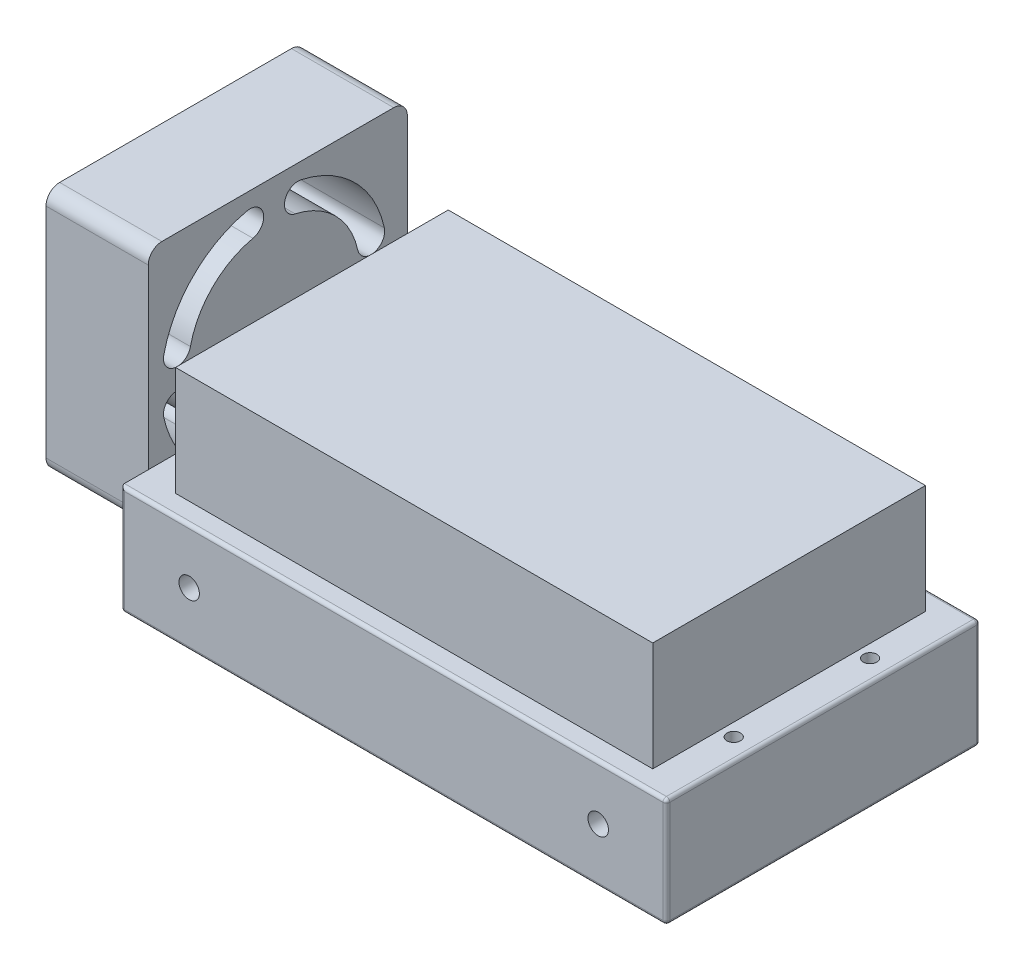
ISO-10303-21;
HEADER;
FILE_DESCRIPTION(('STEP AP214'),'2;1');
FILE_NAME('part.step','',(''),(''),'','','');
FILE_SCHEMA(('AUTOMOTIVE_DESIGN { 1 0 10303 214 1 1 1 1 }'));
ENDSEC;
DATA;
#1=APPLICATION_CONTEXT('core data for automotive mechanical design processes');
#2=APPLICATION_PROTOCOL_DEFINITION('international standard','automotive_design',2000,#1);
#3=PRODUCT_CONTEXT('',#1,'mechanical');
#4=PRODUCT('Part','Part','',(#3));
#5=PRODUCT_RELATED_PRODUCT_CATEGORY('part','',(#4));
#6=PRODUCT_DEFINITION_FORMATION('','',#4);
#7=PRODUCT_DEFINITION_CONTEXT('part definition',#1,'design');
#8=PRODUCT_DEFINITION('design','',#6,#7);
#9=PRODUCT_DEFINITION_SHAPE('','',#8);
#10=(LENGTH_UNIT() NAMED_UNIT(*) SI_UNIT(.MILLI.,.METRE.));
#11=(NAMED_UNIT(*) PLANE_ANGLE_UNIT() SI_UNIT($,.RADIAN.));
#12=(NAMED_UNIT(*) SI_UNIT($,.STERADIAN.) SOLID_ANGLE_UNIT());
#13=UNCERTAINTY_MEASURE_WITH_UNIT(LENGTH_MEASURE(1.E-05),#10,'distance_accuracy_value','');
#14=(GEOMETRIC_REPRESENTATION_CONTEXT(3) GLOBAL_UNCERTAINTY_ASSIGNED_CONTEXT((#13)) GLOBAL_UNIT_ASSIGNED_CONTEXT((#10,
#11,#12)) REPRESENTATION_CONTEXT('',''));
#15=CARTESIAN_POINT('',(0.,0.,0.));
#16=DIRECTION('',(0.,0.,1.));
#17=DIRECTION('',(1.,0.,0.));
#18=AXIS2_PLACEMENT_3D('',#15,#16,#17);
#19=CARTESIAN_POINT('',(0.,16.,0.));
#20=DIRECTION('',(0.,-1.,0.));
#21=DIRECTION('',(0.,0.,-1.));
#22=AXIS2_PLACEMENT_3D('',#19,#20,#21);
#23=PLANE('',#22);
#24=CARTESIAN_POINT('',(36.8736992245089,16.,-10.));
#25=DIRECTION('',(0.,1.,0.));
#26=DIRECTION('',(0.,0.,1.));
#27=AXIS2_PLACEMENT_3D('',#24,#25,#26);
#28=CIRCLE('',#27,0.999999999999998);
#29=CARTESIAN_POINT('',(36.8736992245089,16.,-9.));
#30=VERTEX_POINT('',#29);
#31=EDGE_CURVE('E1882',#30,#30,#28,.T.);
#32=ORIENTED_EDGE('',*,*,#31,.F.);
#33=EDGE_LOOP('',(#32));
#34=FACE_BOUND('',#33,.T.);
#35=CARTESIAN_POINT('',(36.8736992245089,16.,10.));
#36=DIRECTION('',(0.,1.,0.));
#37=DIRECTION('',(0.,0.,1.));
#38=AXIS2_PLACEMENT_3D('',#35,#36,#37);
#39=CIRCLE('',#38,0.999999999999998);
#40=CARTESIAN_POINT('',(36.8736992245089,16.,11.));
#41=VERTEX_POINT('',#40);
#42=EDGE_CURVE('E1884',#41,#41,#39,.T.);
#43=ORIENTED_EDGE('',*,*,#42,.F.);
#44=EDGE_LOOP('',(#43));
#45=FACE_BOUND('',#44,.T.);
#46=DIRECTION('',(0.,0.,-1.));
#47=VECTOR('',#46,1.);
#48=CARTESIAN_POINT('',(39.5,16.,0.));
#49=LINE('',#48,#47);
#50=CARTESIAN_POINT('',(39.5,16.,22.5));
#51=VERTEX_POINT('',#50);
#52=CARTESIAN_POINT('',(39.5,16.,-22.5));
#53=VERTEX_POINT('',#52);
#54=EDGE_CURVE('E654',#51,#53,#49,.T.);
#55=ORIENTED_EDGE('',*,*,#54,.T.);
#56=DIRECTION('',(-1.,0.,0.));
#57=VECTOR('',#56,1.);
#58=CARTESIAN_POINT('',(0.,16.,-22.5));
#59=LINE('',#58,#57);
#60=CARTESIAN_POINT('',(-40.,16.,-22.5));
#61=VERTEX_POINT('',#60);
#62=EDGE_CURVE('E657',#53,#61,#59,.T.);
#63=ORIENTED_EDGE('',*,*,#62,.T.);
#64=DIRECTION('',(0.,0.,1.));
#65=VECTOR('',#64,1.);
#66=CARTESIAN_POINT('',(-40.,16.,23.));
#67=LINE('',#66,#65);
#68=CARTESIAN_POINT('',(-40.,16.,-19.));
#69=VERTEX_POINT('',#68);
#70=EDGE_CURVE('E571',#61,#69,#67,.T.);
#71=ORIENTED_EDGE('',*,*,#70,.T.);
#72=CARTESIAN_POINT('',(-40.,16.,-13.2893098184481));
#73=VERTEX_POINT('',#72);
#74=EDGE_CURVE('E574',#69,#73,#67,.T.);
#75=ORIENTED_EDGE('',*,*,#74,.T.);
#76=CARTESIAN_POINT('',(-40.,16.,-8.03777055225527));
#77=VERTEX_POINT('',#76);
#78=EDGE_CURVE('E809',#73,#77,#67,.T.);
#79=ORIENTED_EDGE('',*,*,#78,.T.);
#80=CARTESIAN_POINT('',(-40.,16.,9.12742574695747));
#81=VERTEX_POINT('',#80);
#82=EDGE_CURVE('E811',#77,#81,#67,.T.);
#83=ORIENTED_EDGE('',*,*,#82,.T.);
#84=CARTESIAN_POINT('',(-40.,16.,14.3789650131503));
#85=VERTEX_POINT('',#84);
#86=EDGE_CURVE('E818',#81,#85,#67,.T.);
#87=ORIENTED_EDGE('',*,*,#86,.T.);
#88=CARTESIAN_POINT('',(-40.,16.,19.));
#89=VERTEX_POINT('',#88);
#90=EDGE_CURVE('E575',#85,#89,#67,.T.);
#91=ORIENTED_EDGE('',*,*,#90,.T.);
#92=CARTESIAN_POINT('',(-40.,16.,22.5));
#93=VERTEX_POINT('',#92);
#94=EDGE_CURVE('E555',#89,#93,#67,.T.);
#95=ORIENTED_EDGE('',*,*,#94,.T.);
#96=DIRECTION('',(1.,0.,0.));
#97=VECTOR('',#96,1.);
#98=CARTESIAN_POINT('',(0.,16.,22.5));
#99=LINE('',#98,#97);
#100=EDGE_CURVE('E651',#93,#51,#99,.T.);
#101=ORIENTED_EDGE('',*,*,#100,.T.);
#102=EDGE_LOOP('',(#55,#63,#71,#75,#79,#83,#87,#91,#95,#101));
#103=FACE_BOUND('',#102,.T.);
#104=DIRECTION('',(0.,0.,1.));
#105=VECTOR('',#104,1.);
#106=CARTESIAN_POINT('',(-35.,16.,20.));
#107=LINE('',#106,#105);
#108=CARTESIAN_POINT('',(-35.,16.,-20.));
#109=VERTEX_POINT('',#108);
#110=CARTESIAN_POINT('',(-35.,16.,20.));
#111=VERTEX_POINT('',#110);
#112=EDGE_CURVE('E345',#109,#111,#107,.T.);
#113=ORIENTED_EDGE('',*,*,#112,.F.);
#114=DIRECTION('',(-1.,0.,0.));
#115=VECTOR('',#114,1.);
#116=CARTESIAN_POINT('',(35.,16.,-20.));
#117=LINE('',#116,#115);
#118=CARTESIAN_POINT('',(35.,16.,-20.));
#119=VERTEX_POINT('',#118);
#120=EDGE_CURVE('E342',#119,#109,#117,.T.);
#121=ORIENTED_EDGE('',*,*,#120,.F.);
#122=DIRECTION('',(0.,0.,-1.));
#123=VECTOR('',#122,1.);
#124=CARTESIAN_POINT('',(35.,16.,20.));
#125=LINE('',#124,#123);
#126=CARTESIAN_POINT('',(35.,16.,20.));
#127=VERTEX_POINT('',#126);
#128=EDGE_CURVE('E74',#127,#119,#125,.T.);
#129=ORIENTED_EDGE('',*,*,#128,.F.);
#130=DIRECTION('',(1.,0.,0.));
#131=VECTOR('',#130,1.);
#132=CARTESIAN_POINT('',(35.,16.,20.));
#133=LINE('',#132,#131);
#134=EDGE_CURVE('E69',#111,#127,#133,.T.);
#135=ORIENTED_EDGE('',*,*,#134,.F.);
#136=EDGE_LOOP('',(#113,#121,#129,#135));
#137=FACE_BOUND('',#136,.T.);
#138=ADVANCED_FACE('F51',(#34,#45,#103,#137),#23,.F.);
#139=CARTESIAN_POINT('',(-40.,16.,23.));
#140=DIRECTION('',(1.,0.,0.));
#141=DIRECTION('',(0.,0.,-1.));
#142=AXIS2_PLACEMENT_3D('',#139,#140,#141);
#143=PLANE('',#142);
#144=ORIENTED_EDGE('',*,*,#70,.F.);
#145=DIRECTION('',(0.,-1.,0.));
#146=VECTOR('',#145,1.);
#147=CARTESIAN_POINT('',(-40.,16.,-22.5));
#148=LINE('',#147,#146);
#149=CARTESIAN_POINT('',(-40.,0.5,-22.5));
#150=VERTEX_POINT('',#149);
#151=EDGE_CURVE('E635',#61,#150,#148,.T.);
#152=ORIENTED_EDGE('',*,*,#151,.T.);
#153=DIRECTION('',(0.,0.,1.));
#154=VECTOR('',#153,1.);
#155=CARTESIAN_POINT('',(-40.,0.5,23.));
#156=LINE('',#155,#154);
#157=CARTESIAN_POINT('',(-40.,0.5,22.5));
#158=VERTEX_POINT('',#157);
#159=EDGE_CURVE('E631',#150,#158,#156,.T.);
#160=ORIENTED_EDGE('',*,*,#159,.T.);
#161=DIRECTION('',(0.,-1.,0.));
#162=VECTOR('',#161,1.);
#163=CARTESIAN_POINT('',(-40.,16.,22.5));
#164=LINE('',#163,#162);
#165=EDGE_CURVE('E628',#158,#93,#164,.F.);
#166=ORIENTED_EDGE('',*,*,#165,.T.);
#167=ORIENTED_EDGE('',*,*,#94,.F.);
#168=DIRECTION('',(0.,1.,0.));
#169=VECTOR('',#168,1.);
#170=CARTESIAN_POINT('',(-40.,8.,19.));
#171=LINE('',#170,#169);
#172=CARTESIAN_POINT('',(-40.,10.,19.));
#173=VERTEX_POINT('',#172);
#174=EDGE_CURVE('E565',#173,#89,#171,.T.);
#175=ORIENTED_EDGE('',*,*,#174,.F.);
#176=CARTESIAN_POINT('',(-40.,10.,17.));
#177=DIRECTION('',(1.,0.,0.));
#178=DIRECTION('',(0.,0.,-1.));
#179=AXIS2_PLACEMENT_3D('',#176,#177,#178);
#180=CIRCLE('',#179,2.);
#181=CARTESIAN_POINT('',(-40.,8.,17.));
#182=VERTEX_POINT('',#181);
#183=EDGE_CURVE('E625',#173,#182,#180,.T.);
#184=ORIENTED_EDGE('',*,*,#183,.T.);
#185=DIRECTION('',(0.,0.,1.));
#186=VECTOR('',#185,1.);
#187=CARTESIAN_POINT('',(-40.,8.,-19.));
#188=LINE('',#187,#186);
#189=CARTESIAN_POINT('',(-40.,8.,-17.));
#190=VERTEX_POINT('',#189);
#191=EDGE_CURVE('E559',#190,#182,#188,.T.);
#192=ORIENTED_EDGE('',*,*,#191,.F.);
#193=CARTESIAN_POINT('',(-40.,10.,-17.));
#194=DIRECTION('',(1.,0.,0.));
#195=DIRECTION('',(0.,0.,-1.));
#196=AXIS2_PLACEMENT_3D('',#193,#194,#195);
#197=CIRCLE('',#196,2.);
#198=CARTESIAN_POINT('',(-40.,10.,-19.));
#199=VERTEX_POINT('',#198);
#200=EDGE_CURVE('E622',#190,#199,#197,.T.);
#201=ORIENTED_EDGE('',*,*,#200,.T.);
#202=DIRECTION('',(0.,-1.,0.));
#203=VECTOR('',#202,1.);
#204=CARTESIAN_POINT('',(-40.,8.,-19.));
#205=LINE('',#204,#203);
#206=EDGE_CURVE('E560',#69,#199,#205,.T.);
#207=ORIENTED_EDGE('',*,*,#206,.F.);
#208=EDGE_LOOP('',(#144,#152,#160,#166,#167,#175,#184,#192,#201,#207));
#209=FACE_BOUND('',#208,.T.);
#210=ADVANCED_FACE('F789',(#209),#143,.F.);
#211=CARTESIAN_POINT('',(40.,16.,23.));
#212=DIRECTION('',(-1.,0.,0.));
#213=DIRECTION('',(0.,0.,1.));
#214=AXIS2_PLACEMENT_3D('',#211,#212,#213);
#215=PLANE('',#214);
#216=DIRECTION('',(0.,-1.,0.));
#217=VECTOR('',#216,1.);
#218=CARTESIAN_POINT('',(40.,16.,-22.5));
#219=LINE('',#218,#217);
#220=CARTESIAN_POINT('',(40.,0.5,-22.5));
#221=VERTEX_POINT('',#220);
#222=CARTESIAN_POINT('',(40.,15.5,-22.5));
#223=VERTEX_POINT('',#222);
#224=EDGE_CURVE('E679',#221,#223,#219,.F.);
#225=ORIENTED_EDGE('',*,*,#224,.T.);
#226=DIRECTION('',(0.,0.,-1.));
#227=VECTOR('',#226,1.);
#228=CARTESIAN_POINT('',(40.,15.5,23.));
#229=LINE('',#228,#227);
#230=CARTESIAN_POINT('',(40.,15.5,22.5));
#231=VERTEX_POINT('',#230);
#232=EDGE_CURVE('E682',#223,#231,#229,.F.);
#233=ORIENTED_EDGE('',*,*,#232,.T.);
#234=DIRECTION('',(0.,-1.,0.));
#235=VECTOR('',#234,1.);
#236=CARTESIAN_POINT('',(40.,16.,22.5));
#237=LINE('',#236,#235);
#238=CARTESIAN_POINT('',(40.,0.5,22.5));
#239=VERTEX_POINT('',#238);
#240=EDGE_CURVE('E673',#231,#239,#237,.T.);
#241=ORIENTED_EDGE('',*,*,#240,.T.);
#242=DIRECTION('',(0.,0.,-1.));
#243=VECTOR('',#242,1.);
#244=CARTESIAN_POINT('',(40.,0.5,-23.));
#245=LINE('',#244,#243);
#246=EDGE_CURVE('E676',#239,#221,#245,.T.);
#247=ORIENTED_EDGE('',*,*,#246,.T.);
#248=EDGE_LOOP('',(#225,#233,#241,#247));
#249=FACE_BOUND('',#248,.T.);
#250=ADVANCED_FACE('F868',(#249),#215,.F.);
#251=CARTESIAN_POINT('',(-40.,16.,-23.));
#252=DIRECTION('',(0.,0.,1.));
#253=DIRECTION('',(1.,0.,0.));
#254=AXIS2_PLACEMENT_3D('',#251,#252,#253);
#255=PLANE('',#254);
#256=DIRECTION('',(0.,-1.,0.));
#257=VECTOR('',#256,1.);
#258=CARTESIAN_POINT('',(-39.5,16.,-23.));
#259=LINE('',#258,#257);
#260=CARTESIAN_POINT('',(-39.5,0.5,-23.));
#261=VERTEX_POINT('',#260);
#262=CARTESIAN_POINT('',(-39.5,15.5,-23.));
#263=VERTEX_POINT('',#262);
#264=EDGE_CURVE('E666',#261,#263,#259,.F.);
#265=ORIENTED_EDGE('',*,*,#264,.T.);
#266=DIRECTION('',(-1.,0.,0.));
#267=VECTOR('',#266,1.);
#268=CARTESIAN_POINT('',(-40.,15.5,-23.));
#269=LINE('',#268,#267);
#270=CARTESIAN_POINT('',(39.5,15.5,-23.));
#271=VERTEX_POINT('',#270);
#272=EDGE_CURVE('E669',#263,#271,#269,.F.);
#273=ORIENTED_EDGE('',*,*,#272,.T.);
#274=DIRECTION('',(0.,-1.,0.));
#275=VECTOR('',#274,1.);
#276=CARTESIAN_POINT('',(39.5,16.,-23.));
#277=LINE('',#276,#275);
#278=CARTESIAN_POINT('',(39.5,0.5,-23.));
#279=VERTEX_POINT('',#278);
#280=EDGE_CURVE('E660',#271,#279,#277,.T.);
#281=ORIENTED_EDGE('',*,*,#280,.T.);
#282=DIRECTION('',(-1.,0.,0.));
#283=VECTOR('',#282,1.);
#284=CARTESIAN_POINT('',(-40.,0.5,-23.));
#285=LINE('',#284,#283);
#286=EDGE_CURVE('E663',#279,#261,#285,.T.);
#287=ORIENTED_EDGE('',*,*,#286,.T.);
#288=EDGE_LOOP('',(#265,#273,#281,#287));
#289=FACE_BOUND('',#288,.T.);
#290=ADVANCED_FACE('F776',(#289),#255,.F.);
#291=CARTESIAN_POINT('',(-40.,16.,23.));
#292=DIRECTION('',(0.,0.,-1.));
#293=DIRECTION('',(-1.,0.,0.));
#294=AXIS2_PLACEMENT_3D('',#291,#292,#293);
#295=PLANE('',#294);
#296=CARTESIAN_POINT('',(-30.,8.,23.));
#297=DIRECTION('',(0.,0.,1.));
#298=DIRECTION('',(1.,0.,0.));
#299=AXIS2_PLACEMENT_3D('',#296,#297,#298);
#300=CIRCLE('',#299,1.5);
#301=CARTESIAN_POINT('',(-28.5,8.,23.));
#302=VERTEX_POINT('',#301);
#303=EDGE_CURVE('E1901',#302,#302,#300,.T.);
#304=ORIENTED_EDGE('',*,*,#303,.F.);
#305=EDGE_LOOP('',(#304));
#306=FACE_BOUND('',#305,.T.);
#307=CARTESIAN_POINT('',(30.,8.,23.));
#308=DIRECTION('',(0.,0.,1.));
#309=DIRECTION('',(1.,0.,0.));
#310=AXIS2_PLACEMENT_3D('',#307,#308,#309);
#311=CIRCLE('',#310,1.5);
#312=CARTESIAN_POINT('',(31.5,8.,23.));
#313=VERTEX_POINT('',#312);
#314=EDGE_CURVE('E1905',#313,#313,#311,.T.);
#315=ORIENTED_EDGE('',*,*,#314,.F.);
#316=EDGE_LOOP('',(#315));
#317=FACE_BOUND('',#316,.T.);
#318=DIRECTION('',(1.,0.,0.));
#319=VECTOR('',#318,1.);
#320=CARTESIAN_POINT('',(-40.,15.5,23.));
#321=LINE('',#320,#319);
#322=CARTESIAN_POINT('',(39.5,15.5,23.));
#323=VERTEX_POINT('',#322);
#324=CARTESIAN_POINT('',(-39.5,15.5,23.));
#325=VERTEX_POINT('',#324);
#326=EDGE_CURVE('E61',#323,#325,#321,.F.);
#327=ORIENTED_EDGE('',*,*,#326,.T.);
#328=DIRECTION('',(0.,-1.,0.));
#329=VECTOR('',#328,1.);
#330=CARTESIAN_POINT('',(-39.5,16.,23.));
#331=LINE('',#330,#329);
#332=CARTESIAN_POINT('',(-39.5,0.5,23.));
#333=VERTEX_POINT('',#332);
#334=EDGE_CURVE('E11',#325,#333,#331,.T.);
#335=ORIENTED_EDGE('',*,*,#334,.T.);
#336=DIRECTION('',(1.,0.,0.));
#337=VECTOR('',#336,1.);
#338=CARTESIAN_POINT('',(40.,0.5,23.));
#339=LINE('',#338,#337);
#340=CARTESIAN_POINT('',(39.5,0.5,23.));
#341=VERTEX_POINT('',#340);
#342=EDGE_CURVE('E686',#333,#341,#339,.T.);
#343=ORIENTED_EDGE('',*,*,#342,.T.);
#344=DIRECTION('',(0.,-1.,0.));
#345=VECTOR('',#344,1.);
#346=CARTESIAN_POINT('',(39.5,16.,23.));
#347=LINE('',#346,#345);
#348=EDGE_CURVE('E689',#341,#323,#347,.F.);
#349=ORIENTED_EDGE('',*,*,#348,.T.);
#350=EDGE_LOOP('',(#327,#335,#343,#349));
#351=FACE_BOUND('',#350,.T.);
#352=ADVANCED_FACE('F878',(#306,#317,#351),#295,.F.);
#353=CARTESIAN_POINT('',(0.,0.,0.));
#354=DIRECTION('',(0.,-1.,0.));
#355=DIRECTION('',(0.,0.,-1.));
#356=AXIS2_PLACEMENT_3D('',#353,#354,#355);
#357=PLANE('',#356);
#358=CARTESIAN_POINT('',(36.8736992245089,0.,-10.));
#359=DIRECTION('',(0.,1.,0.));
#360=DIRECTION('',(0.,0.,1.));
#361=AXIS2_PLACEMENT_3D('',#358,#359,#360);
#362=CIRCLE('',#361,0.999999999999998);
#363=CARTESIAN_POINT('',(36.8736992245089,0.,-9.));
#364=VERTEX_POINT('',#363);
#365=EDGE_CURVE('E1880',#364,#364,#362,.T.);
#366=ORIENTED_EDGE('',*,*,#365,.T.);
#367=EDGE_LOOP('',(#366));
#368=FACE_BOUND('',#367,.T.);
#369=CARTESIAN_POINT('',(36.8736992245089,0.,10.));
#370=DIRECTION('',(0.,1.,0.));
#371=DIRECTION('',(0.,0.,1.));
#372=AXIS2_PLACEMENT_3D('',#369,#370,#371);
#373=CIRCLE('',#372,0.999999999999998);
#374=CARTESIAN_POINT('',(36.8736992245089,0.,11.));
#375=VERTEX_POINT('',#374);
#376=EDGE_CURVE('E1891',#375,#375,#373,.T.);
#377=ORIENTED_EDGE('',*,*,#376,.T.);
#378=EDGE_LOOP('',(#377));
#379=FACE_BOUND('',#378,.T.);
#380=DIRECTION('',(1.,0.,0.));
#381=VECTOR('',#380,1.);
#382=CARTESIAN_POINT('',(-40.,0.,22.5));
#383=LINE('',#382,#381);
#384=CARTESIAN_POINT('',(39.5,0.,22.5));
#385=VERTEX_POINT('',#384);
#386=CARTESIAN_POINT('',(-39.5,0.,22.5));
#387=VERTEX_POINT('',#386);
#388=EDGE_CURVE('E638',#385,#387,#383,.F.);
#389=ORIENTED_EDGE('',*,*,#388,.T.);
#390=DIRECTION('',(0.,0.,1.));
#391=VECTOR('',#390,1.);
#392=CARTESIAN_POINT('',(-39.5,0.,-23.));
#393=LINE('',#392,#391);
#394=CARTESIAN_POINT('',(-39.5,0.,-22.5));
#395=VERTEX_POINT('',#394);
#396=EDGE_CURVE('E647',#387,#395,#393,.F.);
#397=ORIENTED_EDGE('',*,*,#396,.T.);
#398=DIRECTION('',(-1.,0.,0.));
#399=VECTOR('',#398,1.);
#400=CARTESIAN_POINT('',(40.,0.,-22.5));
#401=LINE('',#400,#399);
#402=CARTESIAN_POINT('',(39.5,0.,-22.5));
#403=VERTEX_POINT('',#402);
#404=EDGE_CURVE('E644',#395,#403,#401,.F.);
#405=ORIENTED_EDGE('',*,*,#404,.T.);
#406=DIRECTION('',(0.,0.,-1.));
#407=VECTOR('',#406,1.);
#408=CARTESIAN_POINT('',(39.5,0.,23.));
#409=LINE('',#408,#407);
#410=EDGE_CURVE('E641',#403,#385,#409,.F.);
#411=ORIENTED_EDGE('',*,*,#410,.T.);
#412=EDGE_LOOP('',(#389,#397,#405,#411));
#413=FACE_BOUND('',#412,.T.);
#414=ADVANCED_FACE('F875',(#368,#379,#413),#357,.T.);
#415=CARTESIAN_POINT('',(-40.,0.,0.));
#416=DIRECTION('',(1.,0.,0.));
#417=DIRECTION('',(0.,0.,-1.));
#418=AXIS2_PLACEMENT_3D('',#415,#416,#417);
#419=PLANE('',#418);
#420=CARTESIAN_POINT('',(-40.,42.,-19.));
#421=VERTEX_POINT('',#420);
#422=EDGE_CURVE('E537',#421,#69,#205,.T.);
#423=ORIENTED_EDGE('',*,*,#422,.F.);
#424=CARTESIAN_POINT('',(-40.,42.,-17.));
#425=DIRECTION('',(1.,0.,0.));
#426=DIRECTION('',(0.,0.,-1.));
#427=AXIS2_PLACEMENT_3D('',#424,#425,#426);
#428=CIRCLE('',#427,2.);
#429=CARTESIAN_POINT('',(-40.,44.,-17.));
#430=VERTEX_POINT('',#429);
#431=EDGE_CURVE('E612',#421,#430,#428,.T.);
#432=ORIENTED_EDGE('',*,*,#431,.T.);
#433=DIRECTION('',(0.,0.,-1.));
#434=VECTOR('',#433,1.);
#435=CARTESIAN_POINT('',(-40.,44.,-19.));
#436=LINE('',#435,#434);
#437=CARTESIAN_POINT('',(-40.,44.,17.));
#438=VERTEX_POINT('',#437);
#439=EDGE_CURVE('E543',#438,#430,#436,.T.);
#440=ORIENTED_EDGE('',*,*,#439,.F.);
#441=CARTESIAN_POINT('',(-40.,42.,17.));
#442=DIRECTION('',(1.,0.,0.));
#443=DIRECTION('',(0.,0.,-1.));
#444=AXIS2_PLACEMENT_3D('',#441,#442,#443);
#445=CIRCLE('',#444,2.);
#446=CARTESIAN_POINT('',(-40.,42.,19.));
#447=VERTEX_POINT('',#446);
#448=EDGE_CURVE('E609',#438,#447,#445,.T.);
#449=ORIENTED_EDGE('',*,*,#448,.T.);
#450=EDGE_CURVE('E564',#89,#447,#171,.T.);
#451=ORIENTED_EDGE('',*,*,#450,.F.);
#452=ORIENTED_EDGE('',*,*,#90,.F.);
#453=CARTESIAN_POINT('',(-40.,24.9103448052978,1.0896551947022));
#454=DIRECTION('',(1.,0.,0.));
#455=DIRECTION('',(0.,0.,-1.));
#456=AXIS2_PLACEMENT_3D('',#453,#454,#455);
#457=CIRCLE('',#456,16.);
#458=CARTESIAN_POINT('',(-40.,21.5015094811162,16.7223082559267));
#459=VERTEX_POINT('',#458);
#460=EDGE_CURVE('E408',#85,#459,#457,.F.);
#461=ORIENTED_EDGE('',*,*,#460,.T.);
#462=CARTESIAN_POINT('',(-40.,21.9276138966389,14.7682266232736));
#463=DIRECTION('',(1.,0.,0.));
#464=DIRECTION('',(0.,0.,-1.));
#465=AXIS2_PLACEMENT_3D('',#462,#463,#464);
#466=CIRCLE('',#465,2.);
#467=CARTESIAN_POINT('',(-40.,22.3537183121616,12.8141449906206));
#468=VERTEX_POINT('',#467);
#469=EDGE_CURVE('E437',#459,#468,#466,.F.);
#470=ORIENTED_EDGE('',*,*,#469,.T.);
#471=CARTESIAN_POINT('',(-40.,24.9103448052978,1.0896551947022));
#472=DIRECTION('',(1.,0.,0.));
#473=DIRECTION('',(0.,0.,-1.));
#474=AXIS2_PLACEMENT_3D('',#471,#472,#473);
#475=CIRCLE('',#474,12.);
#476=EDGE_CURVE('E432',#468,#81,#475,.T.);
#477=ORIENTED_EDGE('',*,*,#476,.T.);
#478=ORIENTED_EDGE('',*,*,#82,.F.);
#479=CARTESIAN_POINT('',(-40.,24.9103448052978,0.));
#480=DIRECTION('',(1.,0.,0.));
#481=DIRECTION('',(0.,0.,-1.));
#482=AXIS2_PLACEMENT_3D('',#479,#480,#481);
#483=CIRCLE('',#482,12.);
#484=CARTESIAN_POINT('',(-40.,22.3537183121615,-11.7244897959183));
#485=VERTEX_POINT('',#484);
#486=EDGE_CURVE('E389',#77,#485,#483,.T.);
#487=ORIENTED_EDGE('',*,*,#486,.T.);
#488=CARTESIAN_POINT('',(-40.,21.9276138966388,-13.6785714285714));
#489=DIRECTION('',(1.,0.,0.));
#490=DIRECTION('',(0.,0.,-1.));
#491=AXIS2_PLACEMENT_3D('',#488,#489,#490);
#492=CIRCLE('',#491,2.);
#493=CARTESIAN_POINT('',(-40.,21.5015094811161,-15.6326530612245));
#494=VERTEX_POINT('',#493);
#495=EDGE_CURVE('E379',#485,#494,#492,.F.);
#496=ORIENTED_EDGE('',*,*,#495,.T.);
#497=CARTESIAN_POINT('',(-40.,24.9103448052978,0.));
#498=DIRECTION('',(1.,0.,0.));
#499=DIRECTION('',(0.,0.,-1.));
#500=AXIS2_PLACEMENT_3D('',#497,#498,#499);
#501=CIRCLE('',#500,16.);
#502=EDGE_CURVE('E374',#494,#73,#501,.F.);
#503=ORIENTED_EDGE('',*,*,#502,.T.);
#504=ORIENTED_EDGE('',*,*,#74,.F.);
#505=EDGE_LOOP('',(#423,#432,#440,#449,#451,#452,#461,#470,#477,#478,#487,#496,#503,#504));
#506=FACE_BOUND('',#505,.T.);
#507=CARTESIAN_POINT('',(-40.,26.,1.08965519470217));
#508=DIRECTION('',(1.,0.,0.));
#509=DIRECTION('',(0.,0.,-1.));
#510=AXIS2_PLACEMENT_3D('',#507,#508,#509);
#511=CIRCLE('',#510,16.);
#512=CARTESIAN_POINT('',(-40.,29.4088353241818,16.7223082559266));
#513=VERTEX_POINT('',#512);
#514=CARTESIAN_POINT('',(-40.,41.6326530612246,4.49849051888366));
#515=VERTEX_POINT('',#514);
#516=EDGE_CURVE('E454',#513,#515,#511,.F.);
#517=ORIENTED_EDGE('',*,*,#516,.T.);
#518=CARTESIAN_POINT('',(-40.,39.6785714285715,4.07238610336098));
#519=DIRECTION('',(1.,0.,0.));
#520=DIRECTION('',(0.,0.,-1.));
#521=AXIS2_PLACEMENT_3D('',#518,#519,#520);
#522=CIRCLE('',#521,2.);
#523=CARTESIAN_POINT('',(-40.,37.7244897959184,3.64628168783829));
#524=VERTEX_POINT('',#523);
#525=EDGE_CURVE('E481',#515,#524,#522,.F.);
#526=ORIENTED_EDGE('',*,*,#525,.T.);
#527=CARTESIAN_POINT('',(-40.,26.,1.08965519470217));
#528=DIRECTION('',(1.,0.,0.));
#529=DIRECTION('',(0.,0.,-1.));
#530=AXIS2_PLACEMENT_3D('',#527,#528,#529);
#531=CIRCLE('',#530,12.);
#532=CARTESIAN_POINT('',(-40.,28.5566264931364,12.8141449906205));
#533=VERTEX_POINT('',#532);
#534=EDGE_CURVE('E476',#524,#533,#531,.T.);
#535=ORIENTED_EDGE('',*,*,#534,.T.);
#536=CARTESIAN_POINT('',(-40.,28.9827309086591,14.7682266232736));
#537=DIRECTION('',(1.,0.,0.));
#538=DIRECTION('',(0.,0.,-1.));
#539=AXIS2_PLACEMENT_3D('',#536,#537,#538);
#540=CIRCLE('',#539,2.);
#541=EDGE_CURVE('E471',#533,#513,#540,.F.);
#542=ORIENTED_EDGE('',*,*,#541,.T.);
#543=EDGE_LOOP('',(#517,#526,#535,#542));
#544=FACE_BOUND('',#543,.T.);
#545=CARTESIAN_POINT('',(-40.,26.,0.));
#546=DIRECTION('',(1.,0.,0.));
#547=DIRECTION('',(0.,0.,-1.));
#548=AXIS2_PLACEMENT_3D('',#545,#546,#547);
#549=CIRCLE('',#548,16.);
#550=CARTESIAN_POINT('',(-40.,41.6326530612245,-3.40883532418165));
#551=VERTEX_POINT('',#550);
#552=CARTESIAN_POINT('',(-40.,29.4088353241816,-15.6326530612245));
#553=VERTEX_POINT('',#552);
#554=EDGE_CURVE('E497',#551,#553,#549,.F.);
#555=ORIENTED_EDGE('',*,*,#554,.T.);
#556=CARTESIAN_POINT('',(-40.,28.9827309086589,-13.6785714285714));
#557=DIRECTION('',(1.,0.,0.));
#558=DIRECTION('',(0.,0.,-1.));
#559=AXIS2_PLACEMENT_3D('',#556,#557,#558);
#560=CIRCLE('',#559,2.);
#561=CARTESIAN_POINT('',(-40.,28.5566264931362,-11.7244897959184));
#562=VERTEX_POINT('',#561);
#563=EDGE_CURVE('E524',#553,#562,#560,.F.);
#564=ORIENTED_EDGE('',*,*,#563,.T.);
#565=CARTESIAN_POINT('',(-40.,26.,0.));
#566=DIRECTION('',(1.,0.,0.));
#567=DIRECTION('',(0.,0.,-1.));
#568=AXIS2_PLACEMENT_3D('',#565,#566,#567);
#569=CIRCLE('',#568,12.);
#570=CARTESIAN_POINT('',(-40.,37.7244897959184,-2.55662649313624));
#571=VERTEX_POINT('',#570);
#572=EDGE_CURVE('E519',#562,#571,#569,.T.);
#573=ORIENTED_EDGE('',*,*,#572,.T.);
#574=CARTESIAN_POINT('',(-40.,39.6785714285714,-2.98273090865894));
#575=DIRECTION('',(1.,0.,0.));
#576=DIRECTION('',(0.,0.,-1.));
#577=AXIS2_PLACEMENT_3D('',#574,#575,#576);
#578=CIRCLE('',#577,2.);
#579=EDGE_CURVE('E513',#571,#551,#578,.F.);
#580=ORIENTED_EDGE('',*,*,#579,.T.);
#581=EDGE_LOOP('',(#555,#564,#573,#580));
#582=FACE_BOUND('',#581,.T.);
#583=ADVANCED_FACE('F804',(#506,#544,#582),#419,.T.);
#584=CARTESIAN_POINT('',(-55.,8.,-19.));
#585=DIRECTION('',(0.,0.,1.));
#586=DIRECTION('',(1.,0.,0.));
#587=AXIS2_PLACEMENT_3D('',#584,#585,#586);
#588=PLANE('',#587);
#589=ORIENTED_EDGE('',*,*,#206,.T.);
#590=DIRECTION('',(1.,0.,0.));
#591=VECTOR('',#590,1.);
#592=CARTESIAN_POINT('',(-55.,10.,-19.));
#593=LINE('',#592,#591);
#594=CARTESIAN_POINT('',(-55.,10.,-19.));
#595=VERTEX_POINT('',#594);
#596=EDGE_CURVE('E587',#199,#595,#593,.F.);
#597=ORIENTED_EDGE('',*,*,#596,.T.);
#598=DIRECTION('',(0.,-1.,0.));
#599=VECTOR('',#598,1.);
#600=CARTESIAN_POINT('',(-55.,8.,-19.));
#601=LINE('',#600,#599);
#602=CARTESIAN_POINT('',(-55.,42.,-19.));
#603=VERTEX_POINT('',#602);
#604=EDGE_CURVE('E538',#603,#595,#601,.T.);
#605=ORIENTED_EDGE('',*,*,#604,.F.);
#606=DIRECTION('',(1.,0.,0.));
#607=VECTOR('',#606,1.);
#608=CARTESIAN_POINT('',(-55.,42.,-19.));
#609=LINE('',#608,#607);
#610=EDGE_CURVE('E583',#603,#421,#609,.T.);
#611=ORIENTED_EDGE('',*,*,#610,.T.);
#612=ORIENTED_EDGE('',*,*,#422,.T.);
#613=EDGE_LOOP('',(#589,#597,#605,#611,#612));
#614=FACE_BOUND('',#613,.T.);
#615=ADVANCED_FACE('F799',(#614),#588,.F.);
#616=CARTESIAN_POINT('',(-55.,8.,-19.));
#617=DIRECTION('',(0.,1.,0.));
#618=DIRECTION('',(0.,0.,1.));
#619=AXIS2_PLACEMENT_3D('',#616,#617,#618);
#620=PLANE('',#619);
#621=DIRECTION('',(0.,0.,1.));
#622=VECTOR('',#621,1.);
#623=CARTESIAN_POINT('',(-55.,8.,-19.));
#624=LINE('',#623,#622);
#625=CARTESIAN_POINT('',(-55.,8.,-17.));
#626=VERTEX_POINT('',#625);
#627=CARTESIAN_POINT('',(-55.,8.,17.));
#628=VERTEX_POINT('',#627);
#629=EDGE_CURVE('E542',#626,#628,#624,.T.);
#630=ORIENTED_EDGE('',*,*,#629,.F.);
#631=DIRECTION('',(1.,0.,0.));
#632=VECTOR('',#631,1.);
#633=CARTESIAN_POINT('',(-55.,8.,-17.));
#634=LINE('',#633,#632);
#635=EDGE_CURVE('E579',#626,#190,#634,.T.);
#636=ORIENTED_EDGE('',*,*,#635,.T.);
#637=ORIENTED_EDGE('',*,*,#191,.T.);
#638=DIRECTION('',(1.,0.,0.));
#639=VECTOR('',#638,1.);
#640=CARTESIAN_POINT('',(-55.,8.,17.));
#641=LINE('',#640,#639);
#642=EDGE_CURVE('E576',#182,#628,#641,.F.);
#643=ORIENTED_EDGE('',*,*,#642,.T.);
#644=EDGE_LOOP('',(#630,#636,#637,#643));
#645=FACE_BOUND('',#644,.T.);
#646=ADVANCED_FACE('F1318',(#645),#620,.F.);
#647=CARTESIAN_POINT('',(-55.,8.,19.));
#648=DIRECTION('',(0.,0.,-1.));
#649=DIRECTION('',(-1.,0.,0.));
#650=AXIS2_PLACEMENT_3D('',#647,#648,#649);
#651=PLANE('',#650);
#652=DIRECTION('',(0.,1.,0.));
#653=VECTOR('',#652,1.);
#654=CARTESIAN_POINT('',(-55.,8.,19.));
#655=LINE('',#654,#653);
#656=CARTESIAN_POINT('',(-55.,10.,19.));
#657=VERTEX_POINT('',#656);
#658=CARTESIAN_POINT('',(-55.,42.,19.));
#659=VERTEX_POINT('',#658);
#660=EDGE_CURVE('E547',#657,#659,#655,.T.);
#661=ORIENTED_EDGE('',*,*,#660,.F.);
#662=DIRECTION('',(1.,0.,0.));
#663=VECTOR('',#662,1.);
#664=CARTESIAN_POINT('',(-55.,10.,19.));
#665=LINE('',#664,#663);
#666=EDGE_CURVE('E605',#657,#173,#665,.T.);
#667=ORIENTED_EDGE('',*,*,#666,.T.);
#668=ORIENTED_EDGE('',*,*,#174,.T.);
#669=ORIENTED_EDGE('',*,*,#450,.T.);
#670=DIRECTION('',(1.,0.,0.));
#671=VECTOR('',#670,1.);
#672=CARTESIAN_POINT('',(-55.,42.,19.));
#673=LINE('',#672,#671);
#674=EDGE_CURVE('E602',#447,#659,#673,.F.);
#675=ORIENTED_EDGE('',*,*,#674,.T.);
#676=EDGE_LOOP('',(#661,#667,#668,#669,#675));
#677=FACE_BOUND('',#676,.T.);
#678=ADVANCED_FACE('F1326',(#677),#651,.F.);
#679=CARTESIAN_POINT('',(-55.,44.,-19.));
#680=DIRECTION('',(0.,-1.,0.));
#681=DIRECTION('',(0.,0.,-1.));
#682=AXIS2_PLACEMENT_3D('',#679,#680,#681);
#683=PLANE('',#682);
#684=ORIENTED_EDGE('',*,*,#439,.T.);
#685=DIRECTION('',(1.,0.,0.));
#686=VECTOR('',#685,1.);
#687=CARTESIAN_POINT('',(-55.,44.,-17.));
#688=LINE('',#687,#686);
#689=CARTESIAN_POINT('',(-55.,44.,-17.));
#690=VERTEX_POINT('',#689);
#691=EDGE_CURVE('E619',#430,#690,#688,.F.);
#692=ORIENTED_EDGE('',*,*,#691,.T.);
#693=DIRECTION('',(0.,0.,-1.));
#694=VECTOR('',#693,1.);
#695=CARTESIAN_POINT('',(-55.,44.,-19.));
#696=LINE('',#695,#694);
#697=CARTESIAN_POINT('',(-55.,44.,17.));
#698=VERTEX_POINT('',#697);
#699=EDGE_CURVE('E551',#698,#690,#696,.T.);
#700=ORIENTED_EDGE('',*,*,#699,.F.);
#701=DIRECTION('',(1.,0.,0.));
#702=VECTOR('',#701,1.);
#703=CARTESIAN_POINT('',(-55.,44.,17.));
#704=LINE('',#703,#702);
#705=EDGE_CURVE('E615',#698,#438,#704,.T.);
#706=ORIENTED_EDGE('',*,*,#705,.T.);
#707=EDGE_LOOP('',(#684,#692,#700,#706));
#708=FACE_BOUND('',#707,.T.);
#709=ADVANCED_FACE('F1335',(#708),#683,.F.);
#710=CARTESIAN_POINT('',(-55.,0.,0.));
#711=DIRECTION('',(1.,0.,0.));
#712=DIRECTION('',(0.,0.,-1.));
#713=AXIS2_PLACEMENT_3D('',#710,#711,#712);
#714=PLANE('',#713);
#715=CARTESIAN_POINT('',(-55.,11.2317733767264,-2.98273090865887));
#716=DIRECTION('',(-1.,0.,0.));
#717=DIRECTION('',(0.,1.,0.));
#718=AXIS2_PLACEMENT_3D('',#715,#716,#717);
#719=CIRCLE('',#718,2.);
#720=CARTESIAN_POINT('',(-55.,9.2776917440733,-3.40883532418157));
#721=VERTEX_POINT('',#720);
#722=CARTESIAN_POINT('',(-55.,13.1858550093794,-2.55662649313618));
#723=VERTEX_POINT('',#722);
#724=EDGE_CURVE('E361',#721,#723,#719,.T.);
#725=ORIENTED_EDGE('',*,*,#724,.F.);
#726=CARTESIAN_POINT('',(-55.,24.9103448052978,0.));
#727=DIRECTION('',(-1.,0.,0.));
#728=DIRECTION('',(0.,1.,0.));
#729=AXIS2_PLACEMENT_3D('',#726,#727,#728);
#730=CIRCLE('',#729,16.);
#731=CARTESIAN_POINT('',(-55.,21.5015094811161,-15.6326530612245));
#732=VERTEX_POINT('',#731);
#733=EDGE_CURVE('E365',#732,#721,#730,.T.);
#734=ORIENTED_EDGE('',*,*,#733,.F.);
#735=CARTESIAN_POINT('',(-55.,21.9276138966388,-13.6785714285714));
#736=DIRECTION('',(-1.,0.,0.));
#737=DIRECTION('',(0.,1.,0.));
#738=AXIS2_PLACEMENT_3D('',#735,#736,#737);
#739=CIRCLE('',#738,2.);
#740=CARTESIAN_POINT('',(-55.,22.3537183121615,-11.7244897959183));
#741=VERTEX_POINT('',#740);
#742=EDGE_CURVE('E369',#741,#732,#739,.T.);
#743=ORIENTED_EDGE('',*,*,#742,.F.);
#744=CARTESIAN_POINT('',(-55.,24.9103448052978,0.));
#745=DIRECTION('',(1.,0.,0.));
#746=DIRECTION('',(0.,1.,0.));
#747=AXIS2_PLACEMENT_3D('',#744,#745,#746);
#748=CIRCLE('',#747,12.);
#749=EDGE_CURVE('E357',#723,#741,#748,.T.);
#750=ORIENTED_EDGE('',*,*,#749,.F.);
#751=EDGE_LOOP('',(#725,#734,#743,#750));
#752=FACE_BOUND('',#751,.T.);
#753=CARTESIAN_POINT('',(-55.,21.9276138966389,14.7682266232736));
#754=DIRECTION('',(-1.,0.,0.));
#755=DIRECTION('',(0.,0.,-1.));
#756=AXIS2_PLACEMENT_3D('',#753,#754,#755);
#757=CIRCLE('',#756,2.);
#758=CARTESIAN_POINT('',(-55.,21.5015094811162,16.7223082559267));
#759=VERTEX_POINT('',#758);
#760=CARTESIAN_POINT('',(-55.,22.3537183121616,12.8141449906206));
#761=VERTEX_POINT('',#760);
#762=EDGE_CURVE('E409',#759,#761,#757,.T.);
#763=ORIENTED_EDGE('',*,*,#762,.F.);
#764=CARTESIAN_POINT('',(-55.,24.9103448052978,1.0896551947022));
#765=DIRECTION('',(-1.,0.,0.));
#766=DIRECTION('',(0.,0.,-1.));
#767=AXIS2_PLACEMENT_3D('',#764,#765,#766);
#768=CIRCLE('',#767,16.);
#769=CARTESIAN_POINT('',(-55.,9.27769174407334,4.49849051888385));
#770=VERTEX_POINT('',#769);
#771=EDGE_CURVE('E413',#770,#759,#768,.T.);
#772=ORIENTED_EDGE('',*,*,#771,.F.);
#773=CARTESIAN_POINT('',(-55.,11.2317733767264,4.07238610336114));
#774=DIRECTION('',(-1.,0.,0.));
#775=DIRECTION('',(0.,0.,-1.));
#776=AXIS2_PLACEMENT_3D('',#773,#774,#775);
#777=CIRCLE('',#776,2.);
#778=CARTESIAN_POINT('',(-55.,13.1858550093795,3.64628168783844));
#779=VERTEX_POINT('',#778);
#780=EDGE_CURVE('E417',#779,#770,#777,.T.);
#781=ORIENTED_EDGE('',*,*,#780,.F.);
#782=CARTESIAN_POINT('',(-55.,24.9103448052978,1.0896551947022));
#783=DIRECTION('',(1.,0.,0.));
#784=DIRECTION('',(0.,0.,-1.));
#785=AXIS2_PLACEMENT_3D('',#782,#783,#784);
#786=CIRCLE('',#785,12.);
#787=EDGE_CURVE('E405',#761,#779,#786,.T.);
#788=ORIENTED_EDGE('',*,*,#787,.F.);
#789=EDGE_LOOP('',(#763,#772,#781,#788));
#790=FACE_BOUND('',#789,.T.);
#791=CARTESIAN_POINT('',(-55.,39.6785714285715,4.07238610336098));
#792=DIRECTION('',(-1.,0.,0.));
#793=DIRECTION('',(0.,-1.,0.));
#794=AXIS2_PLACEMENT_3D('',#791,#792,#793);
#795=CIRCLE('',#794,2.);
#796=CARTESIAN_POINT('',(-55.,41.6326530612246,4.49849051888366));
#797=VERTEX_POINT('',#796);
#798=CARTESIAN_POINT('',(-55.,37.7244897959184,3.64628168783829));
#799=VERTEX_POINT('',#798);
#800=EDGE_CURVE('E455',#797,#799,#795,.T.);
#801=ORIENTED_EDGE('',*,*,#800,.F.);
#802=CARTESIAN_POINT('',(-55.,26.,1.08965519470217));
#803=DIRECTION('',(-1.,0.,0.));
#804=DIRECTION('',(0.,-1.,0.));
#805=AXIS2_PLACEMENT_3D('',#802,#803,#804);
#806=CIRCLE('',#805,16.);
#807=CARTESIAN_POINT('',(-55.,29.4088353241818,16.7223082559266));
#808=VERTEX_POINT('',#807);
#809=EDGE_CURVE('E459',#808,#797,#806,.T.);
#810=ORIENTED_EDGE('',*,*,#809,.F.);
#811=CARTESIAN_POINT('',(-55.,28.9827309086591,14.7682266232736));
#812=DIRECTION('',(-1.,0.,0.));
#813=DIRECTION('',(0.,-1.,0.));
#814=AXIS2_PLACEMENT_3D('',#811,#812,#813);
#815=CIRCLE('',#814,2.);
#816=CARTESIAN_POINT('',(-55.,28.5566264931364,12.8141449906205));
#817=VERTEX_POINT('',#816);
#818=EDGE_CURVE('E463',#817,#808,#815,.T.);
#819=ORIENTED_EDGE('',*,*,#818,.F.);
#820=CARTESIAN_POINT('',(-55.,26.,1.08965519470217));
#821=DIRECTION('',(1.,0.,0.));
#822=DIRECTION('',(0.,-1.,0.));
#823=AXIS2_PLACEMENT_3D('',#820,#821,#822);
#824=CIRCLE('',#823,12.);
#825=EDGE_CURVE('E451',#799,#817,#824,.T.);
#826=ORIENTED_EDGE('',*,*,#825,.F.);
#827=EDGE_LOOP('',(#801,#810,#819,#826));
#828=FACE_BOUND('',#827,.T.);
#829=CARTESIAN_POINT('',(-55.,28.9827309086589,-13.6785714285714));
#830=DIRECTION('',(-1.,0.,0.));
#831=DIRECTION('',(0.,0.,1.));
#832=AXIS2_PLACEMENT_3D('',#829,#830,#831);
#833=CIRCLE('',#832,2.);
#834=CARTESIAN_POINT('',(-55.,29.4088353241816,-15.6326530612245));
#835=VERTEX_POINT('',#834);
#836=CARTESIAN_POINT('',(-55.,28.5566264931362,-11.7244897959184));
#837=VERTEX_POINT('',#836);
#838=EDGE_CURVE('E498',#835,#837,#833,.T.);
#839=ORIENTED_EDGE('',*,*,#838,.F.);
#840=CARTESIAN_POINT('',(-55.,26.,0.));
#841=DIRECTION('',(-1.,0.,0.));
#842=DIRECTION('',(0.,0.,1.));
#843=AXIS2_PLACEMENT_3D('',#840,#841,#842);
#844=CIRCLE('',#843,16.);
#845=CARTESIAN_POINT('',(-55.,41.6326530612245,-3.40883532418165));
#846=VERTEX_POINT('',#845);
#847=EDGE_CURVE('E502',#846,#835,#844,.T.);
#848=ORIENTED_EDGE('',*,*,#847,.F.);
#849=CARTESIAN_POINT('',(-55.,39.6785714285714,-2.98273090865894));
#850=DIRECTION('',(-1.,0.,0.));
#851=DIRECTION('',(0.,0.,1.));
#852=AXIS2_PLACEMENT_3D('',#849,#850,#851);
#853=CIRCLE('',#852,2.);
#854=CARTESIAN_POINT('',(-55.,37.7244897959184,-2.55662649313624));
#855=VERTEX_POINT('',#854);
#856=EDGE_CURVE('E404',#855,#846,#853,.T.);
#857=ORIENTED_EDGE('',*,*,#856,.F.);
#858=CARTESIAN_POINT('',(-55.,26.,0.));
#859=DIRECTION('',(1.,0.,0.));
#860=DIRECTION('',(0.,0.,1.));
#861=AXIS2_PLACEMENT_3D('',#858,#859,#860);
#862=CIRCLE('',#861,12.);
#863=EDGE_CURVE('E494',#837,#855,#862,.T.);
#864=ORIENTED_EDGE('',*,*,#863,.F.);
#865=EDGE_LOOP('',(#839,#848,#857,#864));
#866=FACE_BOUND('',#865,.T.);
#867=ORIENTED_EDGE('',*,*,#604,.T.);
#868=CARTESIAN_POINT('',(-55.,10.,-17.));
#869=DIRECTION('',(1.,0.,0.));
#870=DIRECTION('',(0.,0.,-1.));
#871=AXIS2_PLACEMENT_3D('',#868,#869,#870);
#872=CIRCLE('',#871,2.);
#873=EDGE_CURVE('E599',#595,#626,#872,.F.);
#874=ORIENTED_EDGE('',*,*,#873,.T.);
#875=ORIENTED_EDGE('',*,*,#629,.T.);
#876=CARTESIAN_POINT('',(-55.,10.,17.));
#877=DIRECTION('',(1.,0.,0.));
#878=DIRECTION('',(0.,0.,-1.));
#879=AXIS2_PLACEMENT_3D('',#876,#877,#878);
#880=CIRCLE('',#879,2.);
#881=EDGE_CURVE('E596',#628,#657,#880,.F.);
#882=ORIENTED_EDGE('',*,*,#881,.T.);
#883=ORIENTED_EDGE('',*,*,#660,.T.);
#884=CARTESIAN_POINT('',(-55.,42.,17.));
#885=DIRECTION('',(1.,0.,0.));
#886=DIRECTION('',(0.,0.,-1.));
#887=AXIS2_PLACEMENT_3D('',#884,#885,#886);
#888=CIRCLE('',#887,2.);
#889=EDGE_CURVE('E590',#659,#698,#888,.F.);
#890=ORIENTED_EDGE('',*,*,#889,.T.);
#891=ORIENTED_EDGE('',*,*,#699,.T.);
#892=CARTESIAN_POINT('',(-55.,42.,-17.));
#893=DIRECTION('',(1.,0.,0.));
#894=DIRECTION('',(0.,0.,-1.));
#895=AXIS2_PLACEMENT_3D('',#892,#893,#894);
#896=CIRCLE('',#895,2.);
#897=EDGE_CURVE('E593',#690,#603,#896,.F.);
#898=ORIENTED_EDGE('',*,*,#897,.T.);
#899=EDGE_LOOP('',(#867,#874,#875,#882,#883,#890,#891,#898));
#900=FACE_BOUND('',#899,.T.);
#901=ADVANCED_FACE('F840',(#752,#790,#828,#866,#900),#714,.F.);
#902=CARTESIAN_POINT('',(-19.2169430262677,26.,0.));
#903=DIRECTION('',(-1.,0.,0.));
#904=DIRECTION('',(0.,0.,1.));
#905=AXIS2_PLACEMENT_3D('',#902,#903,#904);
#906=CYLINDRICAL_SURFACE('',#905,16.);
#907=DIRECTION('',(-1.,0.,0.));
#908=VECTOR('',#907,1.);
#909=CARTESIAN_POINT('',(-19.2169430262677,41.6326530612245,-3.40883532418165));
#910=LINE('',#909,#908);
#911=EDGE_CURVE('E517',#551,#846,#910,.T.);
#912=ORIENTED_EDGE('',*,*,#911,.T.);
#913=ORIENTED_EDGE('',*,*,#847,.T.);
#914=DIRECTION('',(-1.,0.,0.));
#915=VECTOR('',#914,1.);
#916=CARTESIAN_POINT('',(-19.2169430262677,29.4088353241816,-15.6326530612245));
#917=LINE('',#916,#915);
#918=EDGE_CURVE('E512',#553,#835,#917,.T.);
#919=ORIENTED_EDGE('',*,*,#918,.F.);
#920=ORIENTED_EDGE('',*,*,#554,.F.);
#921=EDGE_LOOP('',(#912,#913,#919,#920));
#922=FACE_BOUND('',#921,.T.);
#923=ADVANCED_FACE('F1353',(#922),#906,.F.);
#924=CARTESIAN_POINT('',(-19.2169430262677,28.9827309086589,-13.6785714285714));
#925=DIRECTION('',(-1.,0.,0.));
#926=DIRECTION('',(0.,0.,1.));
#927=AXIS2_PLACEMENT_3D('',#924,#925,#926);
#928=CYLINDRICAL_SURFACE('',#927,2.);
#929=ORIENTED_EDGE('',*,*,#918,.T.);
#930=ORIENTED_EDGE('',*,*,#838,.T.);
#931=DIRECTION('',(-1.,0.,0.));
#932=VECTOR('',#931,1.);
#933=CARTESIAN_POINT('',(-19.2169430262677,28.5566264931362,-11.7244897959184));
#934=LINE('',#933,#932);
#935=EDGE_CURVE('E523',#562,#837,#934,.T.);
#936=ORIENTED_EDGE('',*,*,#935,.F.);
#937=ORIENTED_EDGE('',*,*,#563,.F.);
#938=EDGE_LOOP('',(#929,#930,#936,#937));
#939=FACE_BOUND('',#938,.T.);
#940=ADVANCED_FACE('F1362',(#939),#928,.F.);
#941=CARTESIAN_POINT('',(-19.2169430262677,26.,0.));
#942=DIRECTION('',(-1.,0.,0.));
#943=DIRECTION('',(0.,0.,1.));
#944=AXIS2_PLACEMENT_3D('',#941,#942,#943);
#945=CYLINDRICAL_SURFACE('',#944,12.);
#946=ORIENTED_EDGE('',*,*,#935,.T.);
#947=ORIENTED_EDGE('',*,*,#863,.T.);
#948=DIRECTION('',(-1.,0.,0.));
#949=VECTOR('',#948,1.);
#950=CARTESIAN_POINT('',(-19.2169430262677,37.7244897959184,-2.55662649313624));
#951=LINE('',#950,#949);
#952=EDGE_CURVE('E518',#571,#855,#951,.T.);
#953=ORIENTED_EDGE('',*,*,#952,.F.);
#954=ORIENTED_EDGE('',*,*,#572,.F.);
#955=EDGE_LOOP('',(#946,#947,#953,#954));
#956=FACE_BOUND('',#955,.T.);
#957=ADVANCED_FACE('F1372',(#956),#945,.T.);
#958=CARTESIAN_POINT('',(-19.2169430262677,39.6785714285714,-2.98273090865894));
#959=DIRECTION('',(-1.,0.,0.));
#960=DIRECTION('',(0.,0.,1.));
#961=AXIS2_PLACEMENT_3D('',#958,#959,#960);
#962=CYLINDRICAL_SURFACE('',#961,2.);
#963=ORIENTED_EDGE('',*,*,#952,.T.);
#964=ORIENTED_EDGE('',*,*,#856,.T.);
#965=ORIENTED_EDGE('',*,*,#911,.F.);
#966=ORIENTED_EDGE('',*,*,#579,.F.);
#967=EDGE_LOOP('',(#963,#964,#965,#966));
#968=FACE_BOUND('',#967,.T.);
#969=ADVANCED_FACE('F1382',(#968),#962,.F.);
#970=CARTESIAN_POINT('',(-19.2169430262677,26.,1.08965519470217));
#971=DIRECTION('',(-1.,0.,0.));
#972=DIRECTION('',(0.,0.,1.));
#973=AXIS2_PLACEMENT_3D('',#970,#971,#972);
#974=CYLINDRICAL_SURFACE('',#973,16.);
#975=DIRECTION('',(-1.,0.,0.));
#976=VECTOR('',#975,1.);
#977=CARTESIAN_POINT('',(-19.2169430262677,29.4088353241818,16.7223082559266));
#978=LINE('',#977,#976);
#979=EDGE_CURVE('E421',#513,#808,#978,.T.);
#980=ORIENTED_EDGE('',*,*,#979,.T.);
#981=ORIENTED_EDGE('',*,*,#809,.T.);
#982=DIRECTION('',(-1.,0.,0.));
#983=VECTOR('',#982,1.);
#984=CARTESIAN_POINT('',(-19.2169430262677,41.6326530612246,4.49849051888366));
#985=LINE('',#984,#983);
#986=EDGE_CURVE('E470',#515,#797,#985,.T.);
#987=ORIENTED_EDGE('',*,*,#986,.F.);
#988=ORIENTED_EDGE('',*,*,#516,.F.);
#989=EDGE_LOOP('',(#980,#981,#987,#988));
#990=FACE_BOUND('',#989,.T.);
#991=ADVANCED_FACE('F1392',(#990),#974,.F.);
#992=CARTESIAN_POINT('',(-19.2169430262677,39.6785714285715,4.07238610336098));
#993=DIRECTION('',(-1.,0.,0.));
#994=DIRECTION('',(0.,0.,1.));
#995=AXIS2_PLACEMENT_3D('',#992,#993,#994);
#996=CYLINDRICAL_SURFACE('',#995,2.);
#997=ORIENTED_EDGE('',*,*,#986,.T.);
#998=ORIENTED_EDGE('',*,*,#800,.T.);
#999=DIRECTION('',(-1.,0.,0.));
#1000=VECTOR('',#999,1.);
#1001=CARTESIAN_POINT('',(-19.2169430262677,37.7244897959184,3.64628168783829));
#1002=LINE('',#1001,#1000);
#1003=EDGE_CURVE('E480',#524,#799,#1002,.T.);
#1004=ORIENTED_EDGE('',*,*,#1003,.F.);
#1005=ORIENTED_EDGE('',*,*,#525,.F.);
#1006=EDGE_LOOP('',(#997,#998,#1004,#1005));
#1007=FACE_BOUND('',#1006,.T.);
#1008=ADVANCED_FACE('F1402',(#1007),#996,.F.);
#1009=CARTESIAN_POINT('',(-19.2169430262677,26.,1.08965519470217));
#1010=DIRECTION('',(-1.,0.,0.));
#1011=DIRECTION('',(0.,0.,1.));
#1012=AXIS2_PLACEMENT_3D('',#1009,#1010,#1011);
#1013=CYLINDRICAL_SURFACE('',#1012,12.);
#1014=ORIENTED_EDGE('',*,*,#1003,.T.);
#1015=ORIENTED_EDGE('',*,*,#825,.T.);
#1016=DIRECTION('',(-1.,0.,0.));
#1017=VECTOR('',#1016,1.);
#1018=CARTESIAN_POINT('',(-19.2169430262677,28.5566264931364,12.8141449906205));
#1019=LINE('',#1018,#1017);
#1020=EDGE_CURVE('E475',#533,#817,#1019,.T.);
#1021=ORIENTED_EDGE('',*,*,#1020,.F.);
#1022=ORIENTED_EDGE('',*,*,#534,.F.);
#1023=EDGE_LOOP('',(#1014,#1015,#1021,#1022));
#1024=FACE_BOUND('',#1023,.T.);
#1025=ADVANCED_FACE('F1412',(#1024),#1013,.T.);
#1026=CARTESIAN_POINT('',(-19.2169430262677,28.9827309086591,14.7682266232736));
#1027=DIRECTION('',(-1.,0.,0.));
#1028=DIRECTION('',(0.,0.,1.));
#1029=AXIS2_PLACEMENT_3D('',#1026,#1027,#1028);
#1030=CYLINDRICAL_SURFACE('',#1029,2.);
#1031=ORIENTED_EDGE('',*,*,#1020,.T.);
#1032=ORIENTED_EDGE('',*,*,#818,.T.);
#1033=ORIENTED_EDGE('',*,*,#979,.F.);
#1034=ORIENTED_EDGE('',*,*,#541,.F.);
#1035=EDGE_LOOP('',(#1031,#1032,#1033,#1034));
#1036=FACE_BOUND('',#1035,.T.);
#1037=ADVANCED_FACE('F860',(#1036),#1030,.F.);
#1038=CARTESIAN_POINT('',(-40.,0.,0.));
#1039=DIRECTION('',(1.,0.,0.));
#1040=DIRECTION('',(0.,0.,-1.));
#1041=AXIS2_PLACEMENT_3D('',#1038,#1039,#1040);
#1042=PLANE('',#1041);
#1043=CARTESIAN_POINT('',(-40.,13.1858550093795,3.64628168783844));
#1044=VERTEX_POINT('',#1043);
#1045=EDGE_CURVE('E436',#81,#1044,#475,.T.);
#1046=ORIENTED_EDGE('',*,*,#1045,.T.);
#1047=CARTESIAN_POINT('',(-40.,11.2317733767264,4.07238610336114));
#1048=DIRECTION('',(1.,0.,0.));
#1049=DIRECTION('',(0.,0.,-1.));
#1050=AXIS2_PLACEMENT_3D('',#1047,#1048,#1049);
#1051=CIRCLE('',#1050,2.);
#1052=CARTESIAN_POINT('',(-40.,9.27769174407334,4.49849051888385));
#1053=VERTEX_POINT('',#1052);
#1054=EDGE_CURVE('E427',#1044,#1053,#1051,.F.);
#1055=ORIENTED_EDGE('',*,*,#1054,.T.);
#1056=EDGE_CURVE('E422',#1053,#85,#457,.F.);
#1057=ORIENTED_EDGE('',*,*,#1056,.T.);
#1058=ORIENTED_EDGE('',*,*,#86,.F.);
#1059=EDGE_LOOP('',(#1046,#1055,#1057,#1058));
#1060=FACE_BOUND('',#1059,.T.);
#1061=ADVANCED_FACE('F847',(#1060),#1042,.F.);
#1062=CARTESIAN_POINT('',(-19.2169430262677,24.9103448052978,1.0896551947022));
#1063=DIRECTION('',(-1.,0.,0.));
#1064=DIRECTION('',(0.,0.,1.));
#1065=AXIS2_PLACEMENT_3D('',#1062,#1063,#1064);
#1066=CYLINDRICAL_SURFACE('',#1065,16.);
#1067=DIRECTION('',(-1.,0.,0.));
#1068=VECTOR('',#1067,1.);
#1069=CARTESIAN_POINT('',(-19.2169430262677,9.27769174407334,4.49849051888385));
#1070=LINE('',#1069,#1068);
#1071=EDGE_CURVE('E373',#1053,#770,#1070,.T.);
#1072=ORIENTED_EDGE('',*,*,#1071,.T.);
#1073=ORIENTED_EDGE('',*,*,#771,.T.);
#1074=DIRECTION('',(-1.,0.,0.));
#1075=VECTOR('',#1074,1.);
#1076=CARTESIAN_POINT('',(-19.2169430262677,21.5015094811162,16.7223082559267));
#1077=LINE('',#1076,#1075);
#1078=EDGE_CURVE('E426',#459,#759,#1077,.T.);
#1079=ORIENTED_EDGE('',*,*,#1078,.F.);
#1080=ORIENTED_EDGE('',*,*,#460,.F.);
#1081=ORIENTED_EDGE('',*,*,#1056,.F.);
#1082=EDGE_LOOP('',(#1072,#1073,#1079,#1080,#1081));
#1083=FACE_BOUND('',#1082,.T.);
#1084=ADVANCED_FACE('F852',(#1083),#1066,.F.);
#1085=CARTESIAN_POINT('',(-19.2169430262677,21.9276138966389,14.7682266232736));
#1086=DIRECTION('',(-1.,0.,0.));
#1087=DIRECTION('',(0.,0.,1.));
#1088=AXIS2_PLACEMENT_3D('',#1085,#1086,#1087);
#1089=CYLINDRICAL_SURFACE('',#1088,2.);
#1090=ORIENTED_EDGE('',*,*,#1078,.T.);
#1091=ORIENTED_EDGE('',*,*,#762,.T.);
#1092=DIRECTION('',(-1.,0.,0.));
#1093=VECTOR('',#1092,1.);
#1094=CARTESIAN_POINT('',(-19.2169430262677,22.3537183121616,12.8141449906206));
#1095=LINE('',#1094,#1093);
#1096=EDGE_CURVE('E441',#468,#761,#1095,.T.);
#1097=ORIENTED_EDGE('',*,*,#1096,.F.);
#1098=ORIENTED_EDGE('',*,*,#469,.F.);
#1099=EDGE_LOOP('',(#1090,#1091,#1097,#1098));
#1100=FACE_BOUND('',#1099,.T.);
#1101=ADVANCED_FACE('F833',(#1100),#1089,.F.);
#1102=CARTESIAN_POINT('',(-19.2169430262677,24.9103448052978,1.0896551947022));
#1103=DIRECTION('',(-1.,0.,0.));
#1104=DIRECTION('',(0.,0.,1.));
#1105=AXIS2_PLACEMENT_3D('',#1102,#1103,#1104);
#1106=CYLINDRICAL_SURFACE('',#1105,12.);
#1107=ORIENTED_EDGE('',*,*,#1096,.T.);
#1108=ORIENTED_EDGE('',*,*,#787,.T.);
#1109=DIRECTION('',(-1.,0.,0.));
#1110=VECTOR('',#1109,1.);
#1111=CARTESIAN_POINT('',(-19.2169430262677,13.1858550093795,3.64628168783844));
#1112=LINE('',#1111,#1110);
#1113=EDGE_CURVE('E431',#1044,#779,#1112,.T.);
#1114=ORIENTED_EDGE('',*,*,#1113,.F.);
#1115=ORIENTED_EDGE('',*,*,#1045,.F.);
#1116=ORIENTED_EDGE('',*,*,#476,.F.);
#1117=EDGE_LOOP('',(#1107,#1108,#1114,#1115,#1116));
#1118=FACE_BOUND('',#1117,.T.);
#1119=ADVANCED_FACE('F830',(#1118),#1106,.T.);
#1120=CARTESIAN_POINT('',(-19.2169430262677,11.2317733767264,4.07238610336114));
#1121=DIRECTION('',(-1.,0.,0.));
#1122=DIRECTION('',(0.,0.,1.));
#1123=AXIS2_PLACEMENT_3D('',#1120,#1121,#1122);
#1124=CYLINDRICAL_SURFACE('',#1123,2.);
#1125=ORIENTED_EDGE('',*,*,#1113,.T.);
#1126=ORIENTED_EDGE('',*,*,#780,.T.);
#1127=ORIENTED_EDGE('',*,*,#1071,.F.);
#1128=ORIENTED_EDGE('',*,*,#1054,.F.);
#1129=EDGE_LOOP('',(#1125,#1126,#1127,#1128));
#1130=FACE_BOUND('',#1129,.T.);
#1131=ADVANCED_FACE('F844',(#1130),#1124,.F.);
#1132=CARTESIAN_POINT('',(-40.,0.,0.));
#1133=DIRECTION('',(1.,0.,0.));
#1134=DIRECTION('',(0.,0.,-1.));
#1135=AXIS2_PLACEMENT_3D('',#1132,#1133,#1134);
#1136=PLANE('',#1135);
#1137=CARTESIAN_POINT('',(-40.,9.2776917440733,-3.40883532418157));
#1138=VERTEX_POINT('',#1137);
#1139=EDGE_CURVE('E360',#73,#1138,#501,.F.);
#1140=ORIENTED_EDGE('',*,*,#1139,.T.);
#1141=CARTESIAN_POINT('',(-40.,11.2317733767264,-2.98273090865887));
#1142=DIRECTION('',(1.,0.,0.));
#1143=DIRECTION('',(0.,0.,-1.));
#1144=AXIS2_PLACEMENT_3D('',#1141,#1142,#1143);
#1145=CIRCLE('',#1144,2.);
#1146=CARTESIAN_POINT('',(-40.,13.1858550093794,-2.55662649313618));
#1147=VERTEX_POINT('',#1146);
#1148=EDGE_CURVE('E390',#1138,#1147,#1145,.F.);
#1149=ORIENTED_EDGE('',*,*,#1148,.T.);
#1150=EDGE_CURVE('E385',#1147,#77,#483,.T.);
#1151=ORIENTED_EDGE('',*,*,#1150,.T.);
#1152=ORIENTED_EDGE('',*,*,#78,.F.);
#1153=EDGE_LOOP('',(#1140,#1149,#1151,#1152));
#1154=FACE_BOUND('',#1153,.T.);
#1155=ADVANCED_FACE('F995',(#1154),#1136,.F.);
#1156=CARTESIAN_POINT('',(-19.2169430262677,24.9103448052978,0.));
#1157=DIRECTION('',(-1.,0.,0.));
#1158=DIRECTION('',(0.,0.,1.));
#1159=AXIS2_PLACEMENT_3D('',#1156,#1157,#1158);
#1160=CYLINDRICAL_SURFACE('',#1159,16.);
#1161=DIRECTION('',(-1.,0.,0.));
#1162=VECTOR('',#1161,1.);
#1163=CARTESIAN_POINT('',(-19.2169430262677,21.5015094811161,-15.6326530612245));
#1164=LINE('',#1163,#1162);
#1165=EDGE_CURVE('E383',#494,#732,#1164,.T.);
#1166=ORIENTED_EDGE('',*,*,#1165,.T.);
#1167=ORIENTED_EDGE('',*,*,#733,.T.);
#1168=DIRECTION('',(-1.,0.,0.));
#1169=VECTOR('',#1168,1.);
#1170=CARTESIAN_POINT('',(-19.2169430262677,9.2776917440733,-3.40883532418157));
#1171=LINE('',#1170,#1169);
#1172=EDGE_CURVE('E378',#1138,#721,#1171,.T.);
#1173=ORIENTED_EDGE('',*,*,#1172,.F.);
#1174=ORIENTED_EDGE('',*,*,#1139,.F.);
#1175=ORIENTED_EDGE('',*,*,#502,.F.);
#1176=EDGE_LOOP('',(#1166,#1167,#1173,#1174,#1175));
#1177=FACE_BOUND('',#1176,.T.);
#1178=ADVANCED_FACE('F1001',(#1177),#1160,.F.);
#1179=CARTESIAN_POINT('',(-19.2169430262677,11.2317733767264,-2.98273090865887));
#1180=DIRECTION('',(-1.,0.,0.));
#1181=DIRECTION('',(0.,0.,1.));
#1182=AXIS2_PLACEMENT_3D('',#1179,#1180,#1181);
#1183=CYLINDRICAL_SURFACE('',#1182,2.);
#1184=ORIENTED_EDGE('',*,*,#1172,.T.);
#1185=ORIENTED_EDGE('',*,*,#724,.T.);
#1186=DIRECTION('',(-1.,0.,0.));
#1187=VECTOR('',#1186,1.);
#1188=CARTESIAN_POINT('',(-19.2169430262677,13.1858550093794,-2.55662649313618));
#1189=LINE('',#1188,#1187);
#1190=EDGE_CURVE('E394',#1147,#723,#1189,.T.);
#1191=ORIENTED_EDGE('',*,*,#1190,.F.);
#1192=ORIENTED_EDGE('',*,*,#1148,.F.);
#1193=EDGE_LOOP('',(#1184,#1185,#1191,#1192));
#1194=FACE_BOUND('',#1193,.T.);
#1195=ADVANCED_FACE('F1000',(#1194),#1183,.F.);
#1196=CARTESIAN_POINT('',(-19.2169430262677,24.9103448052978,0.));
#1197=DIRECTION('',(-1.,0.,0.));
#1198=DIRECTION('',(0.,0.,1.));
#1199=AXIS2_PLACEMENT_3D('',#1196,#1197,#1198);
#1200=CYLINDRICAL_SURFACE('',#1199,12.);
#1201=ORIENTED_EDGE('',*,*,#1190,.T.);
#1202=ORIENTED_EDGE('',*,*,#749,.T.);
#1203=DIRECTION('',(-1.,0.,0.));
#1204=VECTOR('',#1203,1.);
#1205=CARTESIAN_POINT('',(-19.2169430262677,22.3537183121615,-11.7244897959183));
#1206=LINE('',#1205,#1204);
#1207=EDGE_CURVE('E384',#485,#741,#1206,.T.);
#1208=ORIENTED_EDGE('',*,*,#1207,.F.);
#1209=ORIENTED_EDGE('',*,*,#486,.F.);
#1210=ORIENTED_EDGE('',*,*,#1150,.F.);
#1211=EDGE_LOOP('',(#1201,#1202,#1208,#1209,#1210));
#1212=FACE_BOUND('',#1211,.T.);
#1213=ADVANCED_FACE('F1009',(#1212),#1200,.T.);
#1214=CARTESIAN_POINT('',(-19.2169430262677,21.9276138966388,-13.6785714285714));
#1215=DIRECTION('',(-1.,0.,0.));
#1216=DIRECTION('',(0.,0.,1.));
#1217=AXIS2_PLACEMENT_3D('',#1214,#1215,#1216);
#1218=CYLINDRICAL_SURFACE('',#1217,2.);
#1219=ORIENTED_EDGE('',*,*,#1207,.T.);
#1220=ORIENTED_EDGE('',*,*,#742,.T.);
#1221=ORIENTED_EDGE('',*,*,#1165,.F.);
#1222=ORIENTED_EDGE('',*,*,#495,.F.);
#1223=EDGE_LOOP('',(#1219,#1220,#1221,#1222));
#1224=FACE_BOUND('',#1223,.T.);
#1225=ADVANCED_FACE('F892',(#1224),#1218,.F.);
#1226=CARTESIAN_POINT('',(-55.,10.,-17.));
#1227=DIRECTION('',(1.,0.,0.));
#1228=DIRECTION('',(0.,0.,-1.));
#1229=AXIS2_PLACEMENT_3D('',#1226,#1227,#1228);
#1230=CYLINDRICAL_SURFACE('',#1229,2.);
#1231=ORIENTED_EDGE('',*,*,#873,.F.);
#1232=ORIENTED_EDGE('',*,*,#596,.F.);
#1233=ORIENTED_EDGE('',*,*,#200,.F.);
#1234=ORIENTED_EDGE('',*,*,#635,.F.);
#1235=EDGE_LOOP('',(#1231,#1232,#1233,#1234));
#1236=FACE_BOUND('',#1235,.T.);
#1237=ADVANCED_FACE('F888',(#1236),#1230,.T.);
#1238=CARTESIAN_POINT('',(-55.,10.,17.));
#1239=DIRECTION('',(1.,0.,0.));
#1240=DIRECTION('',(0.,0.,-1.));
#1241=AXIS2_PLACEMENT_3D('',#1238,#1239,#1240);
#1242=CYLINDRICAL_SURFACE('',#1241,2.);
#1243=ORIENTED_EDGE('',*,*,#881,.F.);
#1244=ORIENTED_EDGE('',*,*,#642,.F.);
#1245=ORIENTED_EDGE('',*,*,#183,.F.);
#1246=ORIENTED_EDGE('',*,*,#666,.F.);
#1247=EDGE_LOOP('',(#1243,#1244,#1245,#1246));
#1248=FACE_BOUND('',#1247,.T.);
#1249=ADVANCED_FACE('F891',(#1248),#1242,.T.);
#1250=CARTESIAN_POINT('',(-55.,42.,-17.));
#1251=DIRECTION('',(1.,0.,0.));
#1252=DIRECTION('',(0.,0.,-1.));
#1253=AXIS2_PLACEMENT_3D('',#1250,#1251,#1252);
#1254=CYLINDRICAL_SURFACE('',#1253,2.);
#1255=ORIENTED_EDGE('',*,*,#897,.F.);
#1256=ORIENTED_EDGE('',*,*,#691,.F.);
#1257=ORIENTED_EDGE('',*,*,#431,.F.);
#1258=ORIENTED_EDGE('',*,*,#610,.F.);
#1259=EDGE_LOOP('',(#1255,#1256,#1257,#1258));
#1260=FACE_BOUND('',#1259,.T.);
#1261=ADVANCED_FACE('F896',(#1260),#1254,.T.);
#1262=CARTESIAN_POINT('',(-55.,42.,17.));
#1263=DIRECTION('',(1.,0.,0.));
#1264=DIRECTION('',(0.,0.,-1.));
#1265=AXIS2_PLACEMENT_3D('',#1262,#1263,#1264);
#1266=CYLINDRICAL_SURFACE('',#1265,2.);
#1267=ORIENTED_EDGE('',*,*,#889,.F.);
#1268=ORIENTED_EDGE('',*,*,#674,.F.);
#1269=ORIENTED_EDGE('',*,*,#448,.F.);
#1270=ORIENTED_EDGE('',*,*,#705,.F.);
#1271=EDGE_LOOP('',(#1267,#1268,#1269,#1270));
#1272=FACE_BOUND('',#1271,.T.);
#1273=ADVANCED_FACE('F900',(#1272),#1266,.T.);
#1274=CARTESIAN_POINT('',(39.5,15.5,0.));
#1275=DIRECTION('',(0.,0.,-1.));
#1276=DIRECTION('',(-1.,0.,0.));
#1277=AXIS2_PLACEMENT_3D('',#1274,#1275,#1276);
#1278=CYLINDRICAL_SURFACE('',#1277,0.5);
#1279=CARTESIAN_POINT('',(39.5,15.5,22.5));
#1280=DIRECTION('',(0.,0.,1.));
#1281=DIRECTION('',(1.,0.,0.));
#1282=AXIS2_PLACEMENT_3D('',#1279,#1280,#1281);
#1283=CIRCLE('',#1282,0.5);
#1284=EDGE_CURVE('E754',#231,#51,#1283,.T.);
#1285=ORIENTED_EDGE('',*,*,#1284,.F.);
#1286=ORIENTED_EDGE('',*,*,#232,.F.);
#1287=CARTESIAN_POINT('',(39.5,15.5,-22.5));
#1288=DIRECTION('',(0.,0.,-1.));
#1289=DIRECTION('',(-1.,0.,0.));
#1290=AXIS2_PLACEMENT_3D('',#1287,#1288,#1289);
#1291=CIRCLE('',#1290,0.5);
#1292=EDGE_CURVE('E757',#53,#223,#1291,.T.);
#1293=ORIENTED_EDGE('',*,*,#1292,.F.);
#1294=ORIENTED_EDGE('',*,*,#54,.F.);
#1295=EDGE_LOOP('',(#1285,#1286,#1293,#1294));
#1296=FACE_BOUND('',#1295,.T.);
#1297=ADVANCED_FACE('F53',(#1296),#1278,.T.);
#1298=CARTESIAN_POINT('',(39.5,16.,-22.5));
#1299=DIRECTION('',(0.,-1.,0.));
#1300=DIRECTION('',(0.,0.,-1.));
#1301=AXIS2_PLACEMENT_3D('',#1298,#1299,#1300);
#1302=CYLINDRICAL_SURFACE('',#1301,0.5);
#1303=CARTESIAN_POINT('',(39.5,15.5,-22.5));
#1304=DIRECTION('',(0.,1.,0.));
#1305=DIRECTION('',(0.,0.,1.));
#1306=AXIS2_PLACEMENT_3D('',#1303,#1304,#1305);
#1307=CIRCLE('',#1306,0.5);
#1308=EDGE_CURVE('E55',#223,#271,#1307,.T.);
#1309=ORIENTED_EDGE('',*,*,#1308,.F.);
#1310=ORIENTED_EDGE('',*,*,#224,.F.);
#1311=CARTESIAN_POINT('',(39.5,0.5,-22.5));
#1312=DIRECTION('',(0.,-1.,0.));
#1313=DIRECTION('',(0.,0.,-1.));
#1314=AXIS2_PLACEMENT_3D('',#1311,#1312,#1313);
#1315=CIRCLE('',#1314,0.5);
#1316=EDGE_CURVE('E742',#279,#221,#1315,.T.);
#1317=ORIENTED_EDGE('',*,*,#1316,.F.);
#1318=ORIENTED_EDGE('',*,*,#280,.F.);
#1319=EDGE_LOOP('',(#1309,#1310,#1317,#1318));
#1320=FACE_BOUND('',#1319,.T.);
#1321=ADVANCED_FACE('F772',(#1320),#1302,.T.);
#1322=CARTESIAN_POINT('',(39.5,15.5,-22.5));
#1323=DIRECTION('',(1.,0.,0.));
#1324=DIRECTION('',(0.,0.,-1.));
#1325=AXIS2_PLACEMENT_3D('',#1322,#1323,#1324);
#1326=SPHERICAL_SURFACE('',#1325,0.5);
#1327=ORIENTED_EDGE('',*,*,#1292,.T.);
#1328=ORIENTED_EDGE('',*,*,#1308,.T.);
#1329=CARTESIAN_POINT('',(39.5,15.5,-22.5));
#1330=DIRECTION('',(1.,0.,0.));
#1331=DIRECTION('',(0.,0.,-1.));
#1332=AXIS2_PLACEMENT_3D('',#1329,#1330,#1331);
#1333=CIRCLE('',#1332,0.5);
#1334=EDGE_CURVE('E739',#53,#271,#1333,.F.);
#1335=ORIENTED_EDGE('',*,*,#1334,.F.);
#1336=EDGE_LOOP('',(#1327,#1328,#1335));
#1337=FACE_BOUND('',#1336,.T.);
#1338=ADVANCED_FACE('F767',(#1337),#1326,.T.);
#1339=CARTESIAN_POINT('',(39.5,15.5,22.5));
#1340=DIRECTION('',(1.,0.,0.));
#1341=DIRECTION('',(0.,0.,-1.));
#1342=AXIS2_PLACEMENT_3D('',#1339,#1340,#1341);
#1343=SPHERICAL_SURFACE('',#1342,0.5);
#1344=CARTESIAN_POINT('',(39.5,15.5,22.5));
#1345=DIRECTION('',(1.,0.,0.));
#1346=DIRECTION('',(0.,0.,-1.));
#1347=AXIS2_PLACEMENT_3D('',#1344,#1345,#1346);
#1348=CIRCLE('',#1347,0.5);
#1349=EDGE_CURVE('E735',#323,#51,#1348,.F.);
#1350=ORIENTED_EDGE('',*,*,#1349,.F.);
#1351=CARTESIAN_POINT('',(39.5,15.5,22.5));
#1352=DIRECTION('',(0.,1.,0.));
#1353=DIRECTION('',(0.,0.,1.));
#1354=AXIS2_PLACEMENT_3D('',#1351,#1352,#1353);
#1355=CIRCLE('',#1354,0.5);
#1356=EDGE_CURVE('E750',#231,#323,#1355,.F.);
#1357=ORIENTED_EDGE('',*,*,#1356,.F.);
#1358=ORIENTED_EDGE('',*,*,#1284,.T.);
#1359=EDGE_LOOP('',(#1350,#1357,#1358));
#1360=FACE_BOUND('',#1359,.T.);
#1361=ADVANCED_FACE('F952',(#1360),#1343,.T.);
#1362=CARTESIAN_POINT('',(39.5,16.,22.5));
#1363=DIRECTION('',(0.,-1.,0.));
#1364=DIRECTION('',(0.,0.,-1.));
#1365=AXIS2_PLACEMENT_3D('',#1362,#1363,#1364);
#1366=CYLINDRICAL_SURFACE('',#1365,0.5);
#1367=ORIENTED_EDGE('',*,*,#1356,.T.);
#1368=ORIENTED_EDGE('',*,*,#348,.F.);
#1369=CARTESIAN_POINT('',(39.5,0.5,22.5));
#1370=DIRECTION('',(0.,-1.,0.));
#1371=DIRECTION('',(0.,0.,-1.));
#1372=AXIS2_PLACEMENT_3D('',#1369,#1370,#1371);
#1373=CIRCLE('',#1372,0.5);
#1374=EDGE_CURVE('E731',#239,#341,#1373,.T.);
#1375=ORIENTED_EDGE('',*,*,#1374,.F.);
#1376=ORIENTED_EDGE('',*,*,#240,.F.);
#1377=EDGE_LOOP('',(#1367,#1368,#1375,#1376));
#1378=FACE_BOUND('',#1377,.T.);
#1379=ADVANCED_FACE('F948',(#1378),#1366,.T.);
#1380=CARTESIAN_POINT('',(39.5,0.5,23.));
#1381=DIRECTION('',(0.,0.,1.));
#1382=DIRECTION('',(1.,0.,0.));
#1383=AXIS2_PLACEMENT_3D('',#1380,#1381,#1382);
#1384=CYLINDRICAL_SURFACE('',#1383,0.5);
#1385=CARTESIAN_POINT('',(39.5,0.5,-22.5));
#1386=DIRECTION('',(0.,0.,-1.));
#1387=DIRECTION('',(-1.,0.,0.));
#1388=AXIS2_PLACEMENT_3D('',#1385,#1386,#1387);
#1389=CIRCLE('',#1388,0.5);
#1390=EDGE_CURVE('E746',#221,#403,#1389,.T.);
#1391=ORIENTED_EDGE('',*,*,#1390,.F.);
#1392=ORIENTED_EDGE('',*,*,#246,.F.);
#1393=CARTESIAN_POINT('',(39.5,0.5,22.5));
#1394=DIRECTION('',(0.,0.,1.));
#1395=DIRECTION('',(1.,0.,0.));
#1396=AXIS2_PLACEMENT_3D('',#1393,#1394,#1395);
#1397=CIRCLE('',#1396,0.5);
#1398=EDGE_CURVE('E727',#385,#239,#1397,.T.);
#1399=ORIENTED_EDGE('',*,*,#1398,.F.);
#1400=ORIENTED_EDGE('',*,*,#410,.F.);
#1401=EDGE_LOOP('',(#1391,#1392,#1399,#1400));
#1402=FACE_BOUND('',#1401,.T.);
#1403=ADVANCED_FACE('F944',(#1402),#1384,.T.);
#1404=CARTESIAN_POINT('',(39.5,0.5,-22.5));
#1405=DIRECTION('',(1.,0.,0.));
#1406=DIRECTION('',(0.,1.,0.));
#1407=AXIS2_PLACEMENT_3D('',#1404,#1405,#1406);
#1408=SPHERICAL_SURFACE('',#1407,0.5);
#1409=ORIENTED_EDGE('',*,*,#1316,.T.);
#1410=ORIENTED_EDGE('',*,*,#1390,.T.);
#1411=CARTESIAN_POINT('',(39.5,0.5,-22.5));
#1412=DIRECTION('',(1.,0.,0.));
#1413=DIRECTION('',(0.,0.,-1.));
#1414=AXIS2_PLACEMENT_3D('',#1411,#1412,#1413);
#1415=CIRCLE('',#1414,0.5);
#1416=EDGE_CURVE('E723',#279,#403,#1415,.F.);
#1417=ORIENTED_EDGE('',*,*,#1416,.F.);
#1418=EDGE_LOOP('',(#1409,#1410,#1417));
#1419=FACE_BOUND('',#1418,.T.);
#1420=ADVANCED_FACE('F941',(#1419),#1408,.T.);
#1421=CARTESIAN_POINT('',(0.,15.5,-22.5));
#1422=DIRECTION('',(-1.,0.,0.));
#1423=DIRECTION('',(0.,0.,1.));
#1424=AXIS2_PLACEMENT_3D('',#1421,#1422,#1423);
#1425=CYLINDRICAL_SURFACE('',#1424,0.5);
#1426=ORIENTED_EDGE('',*,*,#1334,.T.);
#1427=ORIENTED_EDGE('',*,*,#272,.F.);
#1428=CARTESIAN_POINT('',(-39.5,15.5,-22.5));
#1429=DIRECTION('',(-0.707106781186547,-0.707106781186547,0.));
#1430=DIRECTION('',(0.707106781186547,-0.707106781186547,0.));
#1431=AXIS2_PLACEMENT_3D('',#1428,#1429,#1430);
#1432=ELLIPSE('',#1431,0.707106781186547,0.5);
#1433=EDGE_CURVE('E719',#61,#263,#1432,.T.);
#1434=ORIENTED_EDGE('',*,*,#1433,.F.);
#1435=ORIENTED_EDGE('',*,*,#62,.F.);
#1436=EDGE_LOOP('',(#1426,#1427,#1434,#1435));
#1437=FACE_BOUND('',#1436,.T.);
#1438=ADVANCED_FACE('F780',(#1437),#1425,.T.);
#1439=CARTESIAN_POINT('',(0.,15.5,22.5));
#1440=DIRECTION('',(1.,0.,0.));
#1441=DIRECTION('',(0.,0.,-1.));
#1442=AXIS2_PLACEMENT_3D('',#1439,#1440,#1441);
#1443=CYLINDRICAL_SURFACE('',#1442,0.5);
#1444=ORIENTED_EDGE('',*,*,#1349,.T.);
#1445=ORIENTED_EDGE('',*,*,#100,.F.);
#1446=CARTESIAN_POINT('',(-39.5,15.5,22.5));
#1447=DIRECTION('',(0.707106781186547,0.707106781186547,0.));
#1448=DIRECTION('',(0.707106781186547,-0.707106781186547,0.));
#1449=AXIS2_PLACEMENT_3D('',#1446,#1447,#1448);
#1450=ELLIPSE('',#1449,0.707106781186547,0.5);
#1451=EDGE_CURVE('E715',#325,#93,#1450,.F.);
#1452=ORIENTED_EDGE('',*,*,#1451,.F.);
#1453=ORIENTED_EDGE('',*,*,#326,.F.);
#1454=EDGE_LOOP('',(#1444,#1445,#1452,#1453));
#1455=FACE_BOUND('',#1454,.T.);
#1456=ADVANCED_FACE('F934',(#1455),#1443,.T.);
#1457=CARTESIAN_POINT('',(39.5,0.5,22.5));
#1458=DIRECTION('',(1.,0.,0.));
#1459=DIRECTION('',(0.,1.,0.));
#1460=AXIS2_PLACEMENT_3D('',#1457,#1458,#1459);
#1461=SPHERICAL_SURFACE('',#1460,0.5);
#1462=ORIENTED_EDGE('',*,*,#1398,.T.);
#1463=ORIENTED_EDGE('',*,*,#1374,.T.);
#1464=CARTESIAN_POINT('',(39.5,0.5,22.5));
#1465=DIRECTION('',(1.,0.,0.));
#1466=DIRECTION('',(0.,0.,-1.));
#1467=AXIS2_PLACEMENT_3D('',#1464,#1465,#1466);
#1468=CIRCLE('',#1467,0.5);
#1469=EDGE_CURVE('E711',#385,#341,#1468,.F.);
#1470=ORIENTED_EDGE('',*,*,#1469,.F.);
#1471=EDGE_LOOP('',(#1462,#1463,#1470));
#1472=FACE_BOUND('',#1471,.T.);
#1473=ADVANCED_FACE('F930',(#1472),#1461,.T.);
#1474=CARTESIAN_POINT('',(-40.,0.5,-22.5));
#1475=DIRECTION('',(1.,0.,0.));
#1476=DIRECTION('',(0.,0.,-1.));
#1477=AXIS2_PLACEMENT_3D('',#1474,#1475,#1476);
#1478=CYLINDRICAL_SURFACE('',#1477,0.5);
#1479=ORIENTED_EDGE('',*,*,#1416,.T.);
#1480=ORIENTED_EDGE('',*,*,#404,.F.);
#1481=CARTESIAN_POINT('',(-39.5,0.5,-22.5));
#1482=DIRECTION('',(-1.,0.,0.));
#1483=DIRECTION('',(0.,0.,1.));
#1484=AXIS2_PLACEMENT_3D('',#1481,#1482,#1483);
#1485=CIRCLE('',#1484,0.5);
#1486=EDGE_CURVE('E707',#261,#395,#1485,.T.);
#1487=ORIENTED_EDGE('',*,*,#1486,.F.);
#1488=ORIENTED_EDGE('',*,*,#286,.F.);
#1489=EDGE_LOOP('',(#1479,#1480,#1487,#1488));
#1490=FACE_BOUND('',#1489,.T.);
#1491=ADVANCED_FACE('F927',(#1490),#1478,.T.);
#1492=CARTESIAN_POINT('',(-39.5,16.,-22.5));
#1493=DIRECTION('',(0.,-1.,0.));
#1494=DIRECTION('',(0.,0.,-1.));
#1495=AXIS2_PLACEMENT_3D('',#1492,#1493,#1494);
#1496=CYLINDRICAL_SURFACE('',#1495,0.5);
#1497=ORIENTED_EDGE('',*,*,#1433,.T.);
#1498=ORIENTED_EDGE('',*,*,#264,.F.);
#1499=CARTESIAN_POINT('',(-39.5,0.5,-22.5));
#1500=DIRECTION('',(0.,-1.,0.));
#1501=DIRECTION('',(0.,0.,-1.));
#1502=AXIS2_PLACEMENT_3D('',#1499,#1500,#1501);
#1503=CIRCLE('',#1502,0.5);
#1504=EDGE_CURVE('E703',#150,#261,#1503,.T.);
#1505=ORIENTED_EDGE('',*,*,#1504,.F.);
#1506=ORIENTED_EDGE('',*,*,#151,.F.);
#1507=EDGE_LOOP('',(#1497,#1498,#1505,#1506));
#1508=FACE_BOUND('',#1507,.T.);
#1509=ADVANCED_FACE('F783',(#1508),#1496,.T.);
#1510=CARTESIAN_POINT('',(-39.5,16.,22.5));
#1511=DIRECTION('',(0.,-1.,0.));
#1512=DIRECTION('',(0.,0.,-1.));
#1513=AXIS2_PLACEMENT_3D('',#1510,#1511,#1512);
#1514=CYLINDRICAL_SURFACE('',#1513,0.5);
#1515=ORIENTED_EDGE('',*,*,#1451,.T.);
#1516=ORIENTED_EDGE('',*,*,#165,.F.);
#1517=CARTESIAN_POINT('',(-39.5,0.5,22.5));
#1518=DIRECTION('',(0.,-1.,0.));
#1519=DIRECTION('',(0.,0.,-1.));
#1520=AXIS2_PLACEMENT_3D('',#1517,#1518,#1519);
#1521=CIRCLE('',#1520,0.5);
#1522=EDGE_CURVE('E699',#333,#158,#1521,.T.);
#1523=ORIENTED_EDGE('',*,*,#1522,.F.);
#1524=ORIENTED_EDGE('',*,*,#334,.F.);
#1525=EDGE_LOOP('',(#1515,#1516,#1523,#1524));
#1526=FACE_BOUND('',#1525,.T.);
#1527=ADVANCED_FACE('F920',(#1526),#1514,.T.);
#1528=CARTESIAN_POINT('',(-40.,0.5,22.5));
#1529=DIRECTION('',(-1.,0.,0.));
#1530=DIRECTION('',(0.,0.,1.));
#1531=AXIS2_PLACEMENT_3D('',#1528,#1529,#1530);
#1532=CYLINDRICAL_SURFACE('',#1531,0.5);
#1533=ORIENTED_EDGE('',*,*,#1469,.T.);
#1534=ORIENTED_EDGE('',*,*,#342,.F.);
#1535=CARTESIAN_POINT('',(-39.5,0.5,22.5));
#1536=DIRECTION('',(-1.,0.,0.));
#1537=DIRECTION('',(0.,0.,1.));
#1538=AXIS2_PLACEMENT_3D('',#1535,#1536,#1537);
#1539=CIRCLE('',#1538,0.5);
#1540=EDGE_CURVE('E696',#387,#333,#1539,.T.);
#1541=ORIENTED_EDGE('',*,*,#1540,.F.);
#1542=ORIENTED_EDGE('',*,*,#388,.F.);
#1543=EDGE_LOOP('',(#1533,#1534,#1541,#1542));
#1544=FACE_BOUND('',#1543,.T.);
#1545=ADVANCED_FACE('F916',(#1544),#1532,.T.);
#1546=CARTESIAN_POINT('',(-39.5,0.5,-22.5));
#1547=DIRECTION('',(0.,0.,-1.));
#1548=DIRECTION('',(0.,1.,0.));
#1549=AXIS2_PLACEMENT_3D('',#1546,#1547,#1548);
#1550=SPHERICAL_SURFACE('',#1549,0.5);
#1551=ORIENTED_EDGE('',*,*,#1504,.T.);
#1552=ORIENTED_EDGE('',*,*,#1486,.T.);
#1553=CARTESIAN_POINT('',(-39.5,0.5,-22.5));
#1554=DIRECTION('',(0.,0.,-1.));
#1555=DIRECTION('',(-1.,0.,0.));
#1556=AXIS2_PLACEMENT_3D('',#1553,#1554,#1555);
#1557=CIRCLE('',#1556,0.5);
#1558=EDGE_CURVE('E351',#150,#395,#1557,.F.);
#1559=ORIENTED_EDGE('',*,*,#1558,.F.);
#1560=EDGE_LOOP('',(#1551,#1552,#1559));
#1561=FACE_BOUND('',#1560,.T.);
#1562=ADVANCED_FACE('F912',(#1561),#1550,.T.);
#1563=CARTESIAN_POINT('',(-39.5,0.5,22.5));
#1564=DIRECTION('',(0.,0.,1.));
#1565=DIRECTION('',(0.,-1.,0.));
#1566=AXIS2_PLACEMENT_3D('',#1563,#1564,#1565);
#1567=SPHERICAL_SURFACE('',#1566,0.5);
#1568=ORIENTED_EDGE('',*,*,#1540,.T.);
#1569=ORIENTED_EDGE('',*,*,#1522,.T.);
#1570=CARTESIAN_POINT('',(-39.5,0.5,22.5));
#1571=DIRECTION('',(0.,0.,1.));
#1572=DIRECTION('',(1.,0.,0.));
#1573=AXIS2_PLACEMENT_3D('',#1570,#1571,#1572);
#1574=CIRCLE('',#1573,0.5);
#1575=EDGE_CURVE('E347',#387,#158,#1574,.F.);
#1576=ORIENTED_EDGE('',*,*,#1575,.F.);
#1577=EDGE_LOOP('',(#1568,#1569,#1576));
#1578=FACE_BOUND('',#1577,.T.);
#1579=ADVANCED_FACE('F908',(#1578),#1567,.T.);
#1580=CARTESIAN_POINT('',(-39.5,0.5,23.));
#1581=DIRECTION('',(0.,0.,-1.));
#1582=DIRECTION('',(-1.,0.,0.));
#1583=AXIS2_PLACEMENT_3D('',#1580,#1581,#1582);
#1584=CYLINDRICAL_SURFACE('',#1583,0.5);
#1585=ORIENTED_EDGE('',*,*,#1558,.T.);
#1586=ORIENTED_EDGE('',*,*,#396,.F.);
#1587=ORIENTED_EDGE('',*,*,#1575,.T.);
#1588=ORIENTED_EDGE('',*,*,#159,.F.);
#1589=EDGE_LOOP('',(#1585,#1586,#1587,#1588));
#1590=FACE_BOUND('',#1589,.T.);
#1591=ADVANCED_FACE('F905',(#1590),#1584,.T.);
#1592=CARTESIAN_POINT('',(-35.,32.,20.));
#1593=DIRECTION('',(1.,0.,0.));
#1594=DIRECTION('',(0.,0.,-1.));
#1595=AXIS2_PLACEMENT_3D('',#1592,#1593,#1594);
#1596=PLANE('',#1595);
#1597=ORIENTED_EDGE('',*,*,#112,.T.);
#1598=DIRECTION('',(0.,-1.,0.));
#1599=VECTOR('',#1598,1.);
#1600=CARTESIAN_POINT('',(-35.,32.,20.));
#1601=LINE('',#1600,#1599);
#1602=CARTESIAN_POINT('',(-35.,32.,20.));
#1603=VERTEX_POINT('',#1602);
#1604=EDGE_CURVE('E324',#1603,#111,#1601,.T.);
#1605=ORIENTED_EDGE('',*,*,#1604,.F.);
#1606=DIRECTION('',(0.,0.,1.));
#1607=VECTOR('',#1606,1.);
#1608=CARTESIAN_POINT('',(-35.,32.,20.));
#1609=LINE('',#1608,#1607);
#1610=CARTESIAN_POINT('',(-35.,32.,-20.));
#1611=VERTEX_POINT('',#1610);
#1612=EDGE_CURVE('E332',#1611,#1603,#1609,.T.);
#1613=ORIENTED_EDGE('',*,*,#1612,.F.);
#1614=DIRECTION('',(0.,-1.,0.));
#1615=VECTOR('',#1614,1.);
#1616=CARTESIAN_POINT('',(-35.,32.,-20.));
#1617=LINE('',#1616,#1615);
#1618=EDGE_CURVE('E1916',#1611,#109,#1617,.T.);
#1619=ORIENTED_EDGE('',*,*,#1618,.T.);
#1620=EDGE_LOOP('',(#1597,#1605,#1613,#1619));
#1621=FACE_BOUND('',#1620,.T.);
#1622=ADVANCED_FACE('F344',(#1621),#1596,.F.);
#1623=CARTESIAN_POINT('',(35.,32.,20.));
#1624=DIRECTION('',(0.,0.,-1.));
#1625=DIRECTION('',(-1.,0.,0.));
#1626=AXIS2_PLACEMENT_3D('',#1623,#1624,#1625);
#1627=PLANE('',#1626);
#1628=ORIENTED_EDGE('',*,*,#134,.T.);
#1629=DIRECTION('',(0.,-1.,0.));
#1630=VECTOR('',#1629,1.);
#1631=CARTESIAN_POINT('',(35.,32.,20.));
#1632=LINE('',#1631,#1630);
#1633=CARTESIAN_POINT('',(35.,32.,20.));
#1634=VERTEX_POINT('',#1633);
#1635=EDGE_CURVE('E327',#1634,#127,#1632,.T.);
#1636=ORIENTED_EDGE('',*,*,#1635,.F.);
#1637=DIRECTION('',(1.,0.,0.));
#1638=VECTOR('',#1637,1.);
#1639=CARTESIAN_POINT('',(35.,32.,20.));
#1640=LINE('',#1639,#1638);
#1641=EDGE_CURVE('E320',#1603,#1634,#1640,.T.);
#1642=ORIENTED_EDGE('',*,*,#1641,.F.);
#1643=ORIENTED_EDGE('',*,*,#1604,.T.);
#1644=EDGE_LOOP('',(#1628,#1636,#1642,#1643));
#1645=FACE_BOUND('',#1644,.T.);
#1646=ADVANCED_FACE('F322',(#1645),#1627,.F.);
#1647=CARTESIAN_POINT('',(35.,32.,20.));
#1648=DIRECTION('',(-1.,0.,0.));
#1649=DIRECTION('',(0.,0.,1.));
#1650=AXIS2_PLACEMENT_3D('',#1647,#1648,#1649);
#1651=PLANE('',#1650);
#1652=ORIENTED_EDGE('',*,*,#128,.T.);
#1653=DIRECTION('',(0.,-1.,0.));
#1654=VECTOR('',#1653,1.);
#1655=CARTESIAN_POINT('',(35.,32.,-20.));
#1656=LINE('',#1655,#1654);
#1657=CARTESIAN_POINT('',(35.,32.,-20.));
#1658=VERTEX_POINT('',#1657);
#1659=EDGE_CURVE('E353',#1658,#119,#1656,.T.);
#1660=ORIENTED_EDGE('',*,*,#1659,.F.);
#1661=DIRECTION('',(0.,0.,-1.));
#1662=VECTOR('',#1661,1.);
#1663=CARTESIAN_POINT('',(35.,32.,20.));
#1664=LINE('',#1663,#1662);
#1665=EDGE_CURVE('E331',#1634,#1658,#1664,.T.);
#1666=ORIENTED_EDGE('',*,*,#1665,.F.);
#1667=ORIENTED_EDGE('',*,*,#1635,.T.);
#1668=EDGE_LOOP('',(#1652,#1660,#1666,#1667));
#1669=FACE_BOUND('',#1668,.T.);
#1670=ADVANCED_FACE('F1195',(#1669),#1651,.F.);
#1671=CARTESIAN_POINT('',(35.,32.,-20.));
#1672=DIRECTION('',(0.,0.,1.));
#1673=DIRECTION('',(1.,0.,0.));
#1674=AXIS2_PLACEMENT_3D('',#1671,#1672,#1673);
#1675=PLANE('',#1674);
#1676=ORIENTED_EDGE('',*,*,#120,.T.);
#1677=ORIENTED_EDGE('',*,*,#1618,.F.);
#1678=DIRECTION('',(-1.,0.,0.));
#1679=VECTOR('',#1678,1.);
#1680=CARTESIAN_POINT('',(35.,32.,-20.));
#1681=LINE('',#1680,#1679);
#1682=EDGE_CURVE('E337',#1658,#1611,#1681,.T.);
#1683=ORIENTED_EDGE('',*,*,#1682,.F.);
#1684=ORIENTED_EDGE('',*,*,#1659,.T.);
#1685=EDGE_LOOP('',(#1676,#1677,#1683,#1684));
#1686=FACE_BOUND('',#1685,.T.);
#1687=ADVANCED_FACE('F1203',(#1686),#1675,.F.);
#1688=CARTESIAN_POINT('',(0.,32.,0.));
#1689=DIRECTION('',(0.,1.,0.));
#1690=DIRECTION('',(0.,0.,1.));
#1691=AXIS2_PLACEMENT_3D('',#1688,#1689,#1690);
#1692=PLANE('',#1691);
#1693=ORIENTED_EDGE('',*,*,#1612,.T.);
#1694=ORIENTED_EDGE('',*,*,#1641,.T.);
#1695=ORIENTED_EDGE('',*,*,#1665,.T.);
#1696=ORIENTED_EDGE('',*,*,#1682,.T.);
#1697=EDGE_LOOP('',(#1693,#1694,#1695,#1696));
#1698=FACE_BOUND('',#1697,.T.);
#1699=ADVANCED_FACE('F335',(#1698),#1692,.T.);
#1700=CARTESIAN_POINT('',(30.,8.,17.));
#1701=DIRECTION('',(0.,0.,1.));
#1702=DIRECTION('',(1.,0.,0.));
#1703=AXIS2_PLACEMENT_3D('',#1700,#1701,#1702);
#1704=CYLINDRICAL_SURFACE('',#1703,1.5);
#1705=CARTESIAN_POINT('',(30.,8.,17.));
#1706=DIRECTION('',(0.,0.,1.));
#1707=DIRECTION('',(1.,0.,0.));
#1708=AXIS2_PLACEMENT_3D('',#1705,#1706,#1707);
#1709=CIRCLE('',#1708,1.5);
#1710=CARTESIAN_POINT('',(31.5,8.,17.));
#1711=VERTEX_POINT('',#1710);
#1712=EDGE_CURVE('E1888',#1711,#1711,#1709,.T.);
#1713=ORIENTED_EDGE('',*,*,#1712,.F.);
#1714=EDGE_LOOP('',(#1713));
#1715=FACE_BOUND('',#1714,.T.);
#1716=ORIENTED_EDGE('',*,*,#314,.T.);
#1717=EDGE_LOOP('',(#1716));
#1718=FACE_BOUND('',#1717,.T.);
#1719=ADVANCED_FACE('F1222',(#1715,#1718),#1704,.F.);
#1720=CARTESIAN_POINT('',(30.,8.,17.));
#1721=DIRECTION('',(0.,0.,1.));
#1722=DIRECTION('',(1.,0.,0.));
#1723=AXIS2_PLACEMENT_3D('',#1720,#1721,#1722);
#1724=PLANE('',#1723);
#1725=ORIENTED_EDGE('',*,*,#1712,.T.);
#1726=EDGE_LOOP('',(#1725));
#1727=FACE_BOUND('',#1726,.T.);
#1728=ADVANCED_FACE('F1231',(#1727),#1724,.T.);
#1729=CARTESIAN_POINT('',(-30.,8.,17.));
#1730=DIRECTION('',(0.,0.,1.));
#1731=DIRECTION('',(1.,0.,0.));
#1732=AXIS2_PLACEMENT_3D('',#1729,#1730,#1731);
#1733=CYLINDRICAL_SURFACE('',#1732,1.5);
#1734=CARTESIAN_POINT('',(-30.,8.,17.));
#1735=DIRECTION('',(0.,0.,1.));
#1736=DIRECTION('',(1.,0.,0.));
#1737=AXIS2_PLACEMENT_3D('',#1734,#1735,#1736);
#1738=CIRCLE('',#1737,1.5);
#1739=CARTESIAN_POINT('',(-28.5,8.,17.));
#1740=VERTEX_POINT('',#1739);
#1741=EDGE_CURVE('E1897',#1740,#1740,#1738,.T.);
#1742=ORIENTED_EDGE('',*,*,#1741,.F.);
#1743=EDGE_LOOP('',(#1742));
#1744=FACE_BOUND('',#1743,.T.);
#1745=ORIENTED_EDGE('',*,*,#303,.T.);
#1746=EDGE_LOOP('',(#1745));
#1747=FACE_BOUND('',#1746,.T.);
#1748=ADVANCED_FACE('F1241',(#1744,#1747),#1733,.F.);
#1749=CARTESIAN_POINT('',(-30.,8.,17.));
#1750=DIRECTION('',(0.,0.,1.));
#1751=DIRECTION('',(1.,0.,0.));
#1752=AXIS2_PLACEMENT_3D('',#1749,#1750,#1751);
#1753=PLANE('',#1752);
#1754=ORIENTED_EDGE('',*,*,#1741,.T.);
#1755=EDGE_LOOP('',(#1754));
#1756=FACE_BOUND('',#1755,.T.);
#1757=ADVANCED_FACE('F1251',(#1756),#1753,.T.);
#1758=CARTESIAN_POINT('',(36.8736992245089,0.,10.));
#1759=DIRECTION('',(0.,1.,0.));
#1760=DIRECTION('',(0.,0.,1.));
#1761=AXIS2_PLACEMENT_3D('',#1758,#1759,#1760);
#1762=CYLINDRICAL_SURFACE('',#1761,0.999999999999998);
#1763=ORIENTED_EDGE('',*,*,#376,.F.);
#1764=EDGE_LOOP('',(#1763));
#1765=FACE_BOUND('',#1764,.T.);
#1766=ORIENTED_EDGE('',*,*,#42,.T.);
#1767=EDGE_LOOP('',(#1766));
#1768=FACE_BOUND('',#1767,.T.);
#1769=ADVANCED_FACE('F1261',(#1765,#1768),#1762,.F.);
#1770=CARTESIAN_POINT('',(36.8736992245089,0.,-10.));
#1771=DIRECTION('',(0.,1.,0.));
#1772=DIRECTION('',(0.,0.,1.));
#1773=AXIS2_PLACEMENT_3D('',#1770,#1771,#1772);
#1774=CYLINDRICAL_SURFACE('',#1773,0.999999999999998);
#1775=ORIENTED_EDGE('',*,*,#365,.F.);
#1776=EDGE_LOOP('',(#1775));
#1777=FACE_BOUND('',#1776,.T.);
#1778=ORIENTED_EDGE('',*,*,#31,.T.);
#1779=EDGE_LOOP('',(#1778));
#1780=FACE_BOUND('',#1779,.T.);
#1781=ADVANCED_FACE('F1271',(#1777,#1780),#1774,.F.);
#1782=CLOSED_SHELL('',(#138,#210,#250,#290,#352,#414,#583,#615,#646,#678,#709,#901,#923,#940,
#957,#969,#991,#1008,#1025,#1037,#1061,#1084,#1101,#1119,#1131,#1155,#1178,#1195,#1213,#1225,
#1237,#1249,#1261,#1273,#1297,#1321,#1338,#1361,#1379,#1403,#1420,#1438,#1456,#1473,#1491,#1509,
#1527,#1545,#1562,#1579,#1591,#1622,#1646,#1670,#1687,#1699,#1719,#1728,#1748,#1757,#1769,#1781));
#1783=MANIFOLD_SOLID_BREP('B2',#1782);
#1784=ADVANCED_BREP_SHAPE_REPRESENTATION('',(#18,#1783),#14);
#1785=SHAPE_DEFINITION_REPRESENTATION(#9,#1784);
ENDSEC;
END-ISO-10303-21;
